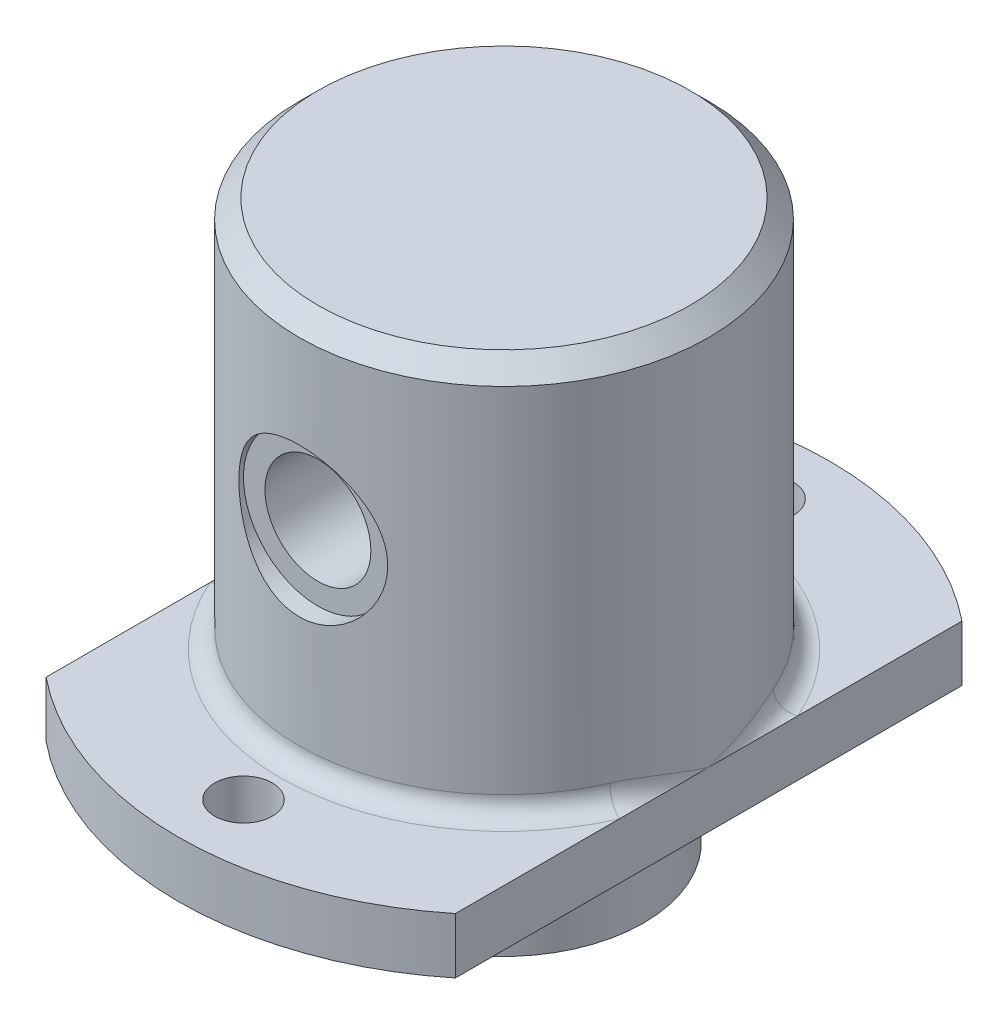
ISO-10303-21;
HEADER;
FILE_DESCRIPTION(('STEP AP214'),'2;1');
FILE_NAME('part.step','',(''),(''),'','','');
FILE_SCHEMA(('AUTOMOTIVE_DESIGN { 1 0 10303 214 1 1 1 1 }'));
ENDSEC;
DATA;
#1=APPLICATION_CONTEXT('core data for automotive mechanical design processes');
#2=APPLICATION_PROTOCOL_DEFINITION('international standard','automotive_design',2000,#1);
#3=PRODUCT_CONTEXT('',#1,'mechanical');
#4=PRODUCT('Part','Part','',(#3));
#5=PRODUCT_RELATED_PRODUCT_CATEGORY('part','',(#4));
#6=PRODUCT_DEFINITION_FORMATION('','',#4);
#7=PRODUCT_DEFINITION_CONTEXT('part definition',#1,'design');
#8=PRODUCT_DEFINITION('design','',#6,#7);
#9=PRODUCT_DEFINITION_SHAPE('','',#8);
#10=(LENGTH_UNIT() NAMED_UNIT(*) SI_UNIT(.MILLI.,.METRE.));
#11=(NAMED_UNIT(*) PLANE_ANGLE_UNIT() SI_UNIT($,.RADIAN.));
#12=(NAMED_UNIT(*) SI_UNIT($,.STERADIAN.) SOLID_ANGLE_UNIT());
#13=UNCERTAINTY_MEASURE_WITH_UNIT(LENGTH_MEASURE(1.E-05),#10,'distance_accuracy_value','');
#14=(GEOMETRIC_REPRESENTATION_CONTEXT(3) GLOBAL_UNCERTAINTY_ASSIGNED_CONTEXT((#13)) GLOBAL_UNIT_ASSIGNED_CONTEXT((#10,
#11,#12)) REPRESENTATION_CONTEXT('',''));
#15=CARTESIAN_POINT('',(0.,0.,0.));
#16=DIRECTION('',(0.,0.,1.));
#17=DIRECTION('',(1.,0.,0.));
#18=AXIS2_PLACEMENT_3D('',#15,#16,#17);
#19=CARTESIAN_POINT('',(-11.,9.,0.));
#20=DIRECTION('',(0.,1.,0.));
#21=DIRECTION('',(0.,0.,1.));
#22=AXIS2_PLACEMENT_3D('',#19,#20,#21);
#23=PLANE('',#22);
#24=CARTESIAN_POINT('',(0.,9.,14.));
#25=DIRECTION('',(0.,1.,0.));
#26=DIRECTION('',(0.,0.,1.));
#27=AXIS2_PLACEMENT_3D('',#24,#25,#26);
#28=CIRCLE('',#27,1.55);
#29=CARTESIAN_POINT('',(0.,9.,15.55));
#30=VERTEX_POINT('',#29);
#31=EDGE_CURVE('E217',#30,#30,#28,.T.);
#32=ORIENTED_EDGE('',*,*,#31,.F.);
#33=EDGE_LOOP('',(#32));
#34=FACE_BOUND('',#33,.T.);
#35=DIRECTION('',(0.,0.,-1.));
#36=VECTOR('',#35,1.);
#37=CARTESIAN_POINT('',(11.,9.,0.));
#38=LINE('',#37,#36);
#39=CARTESIAN_POINT('',(11.,9.,13.6106575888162));
#40=VERTEX_POINT('',#39);
#41=CARTESIAN_POINT('',(11.,9.,4.79583152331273));
#42=VERTEX_POINT('',#41);
#43=EDGE_CURVE('E246',#40,#42,#38,.T.);
#44=ORIENTED_EDGE('',*,*,#43,.T.);
#45=CARTESIAN_POINT('',(0.,9.,0.));
#46=DIRECTION('',(0.,1.,0.));
#47=DIRECTION('',(0.,0.,1.));
#48=AXIS2_PLACEMENT_3D('',#45,#46,#47);
#49=CIRCLE('',#48,12.);
#50=CARTESIAN_POINT('',(-11.,9.,4.79583152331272));
#51=VERTEX_POINT('',#50);
#52=EDGE_CURVE('E129',#42,#51,#49,.F.);
#53=ORIENTED_EDGE('',*,*,#52,.T.);
#54=DIRECTION('',(0.,0.,-1.));
#55=VECTOR('',#54,1.);
#56=CARTESIAN_POINT('',(-11.,9.,0.));
#57=LINE('',#56,#55);
#58=CARTESIAN_POINT('',(-11.,9.,13.6106575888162));
#59=VERTEX_POINT('',#58);
#60=EDGE_CURVE('E114',#59,#51,#57,.T.);
#61=ORIENTED_EDGE('',*,*,#60,.F.);
#62=CARTESIAN_POINT('',(0.,9.,0.));
#63=DIRECTION('',(0.,1.,0.));
#64=DIRECTION('',(0.,0.,1.));
#65=AXIS2_PLACEMENT_3D('',#62,#63,#64);
#66=CIRCLE('',#65,17.5);
#67=EDGE_CURVE('E127',#59,#40,#66,.T.);
#68=ORIENTED_EDGE('',*,*,#67,.T.);
#69=EDGE_LOOP('',(#44,#53,#61,#68));
#70=FACE_BOUND('',#69,.T.);
#71=ADVANCED_FACE('F38',(#34,#70),#23,.T.);
#72=CARTESIAN_POINT('',(0.,9.,-14.));
#73=DIRECTION('',(0.,1.,0.));
#74=DIRECTION('',(0.,0.,1.));
#75=AXIS2_PLACEMENT_3D('',#72,#73,#74);
#76=CIRCLE('',#75,1.55);
#77=CARTESIAN_POINT('',(0.,9.,-12.45));
#78=VERTEX_POINT('',#77);
#79=EDGE_CURVE('E226',#78,#78,#76,.T.);
#80=ORIENTED_EDGE('',*,*,#79,.F.);
#81=EDGE_LOOP('',(#80));
#82=FACE_BOUND('',#81,.T.);
#83=CARTESIAN_POINT('',(-11.,9.,-4.79583152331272));
#84=VERTEX_POINT('',#83);
#85=CARTESIAN_POINT('',(-11.,9.,-13.6106575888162));
#86=VERTEX_POINT('',#85);
#87=EDGE_CURVE('E61',#84,#86,#57,.T.);
#88=ORIENTED_EDGE('',*,*,#87,.F.);
#89=CARTESIAN_POINT('',(0.,9.,0.));
#90=DIRECTION('',(0.,1.,0.));
#91=DIRECTION('',(0.,0.,1.));
#92=AXIS2_PLACEMENT_3D('',#89,#90,#91);
#93=CIRCLE('',#92,12.);
#94=CARTESIAN_POINT('',(11.,9.,-4.79583152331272));
#95=VERTEX_POINT('',#94);
#96=EDGE_CURVE('E56',#84,#95,#93,.F.);
#97=ORIENTED_EDGE('',*,*,#96,.T.);
#98=CARTESIAN_POINT('',(11.,9.,-13.6106575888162));
#99=VERTEX_POINT('',#98);
#100=EDGE_CURVE('E240',#95,#99,#38,.T.);
#101=ORIENTED_EDGE('',*,*,#100,.T.);
#102=EDGE_CURVE('E137',#99,#86,#66,.T.);
#103=ORIENTED_EDGE('',*,*,#102,.T.);
#104=EDGE_LOOP('',(#88,#97,#101,#103));
#105=FACE_BOUND('',#104,.T.);
#106=ADVANCED_FACE('F356',(#82,#105),#23,.T.);
#107=CARTESIAN_POINT('',(0.,0.,0.));
#108=DIRECTION('',(0.,1.,0.));
#109=DIRECTION('',(0.,0.,1.));
#110=AXIS2_PLACEMENT_3D('',#107,#108,#109);
#111=CYLINDRICAL_SURFACE('',#110,17.5);
#112=DIRECTION('',(0.,1.,0.));
#113=VECTOR('',#112,1.);
#114=CARTESIAN_POINT('',(-11.,-0.999999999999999,-13.6106575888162));
#115=LINE('',#114,#113);
#116=CARTESIAN_POINT('',(-11.,6.,-13.6106575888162));
#117=VERTEX_POINT('',#116);
#118=EDGE_CURVE('E122',#117,#86,#115,.T.);
#119=ORIENTED_EDGE('',*,*,#118,.T.);
#120=ORIENTED_EDGE('',*,*,#102,.F.);
#121=DIRECTION('',(0.,1.,0.));
#122=VECTOR('',#121,1.);
#123=CARTESIAN_POINT('',(11.,-0.999999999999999,-13.6106575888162));
#124=LINE('',#123,#122);
#125=CARTESIAN_POINT('',(11.,6.,-13.6106575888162));
#126=VERTEX_POINT('',#125);
#127=EDGE_CURVE('E250',#126,#99,#124,.T.);
#128=ORIENTED_EDGE('',*,*,#127,.F.);
#129=CARTESIAN_POINT('',(0.,6.,0.));
#130=DIRECTION('',(0.,1.,0.));
#131=DIRECTION('',(0.,0.,1.));
#132=AXIS2_PLACEMENT_3D('',#129,#130,#131);
#133=CIRCLE('',#132,17.5);
#134=EDGE_CURVE('E138',#126,#117,#133,.T.);
#135=ORIENTED_EDGE('',*,*,#134,.T.);
#136=EDGE_LOOP('',(#119,#120,#128,#135));
#137=FACE_BOUND('',#136,.T.);
#138=ADVANCED_FACE('F361',(#137),#111,.T.);
#139=DIRECTION('',(0.,1.,0.));
#140=VECTOR('',#139,1.);
#141=CARTESIAN_POINT('',(-11.,-0.999999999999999,13.6106575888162));
#142=LINE('',#141,#140);
#143=CARTESIAN_POINT('',(-11.,6.,13.6106575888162));
#144=VERTEX_POINT('',#143);
#145=EDGE_CURVE('E111',#144,#59,#142,.T.);
#146=ORIENTED_EDGE('',*,*,#145,.F.);
#147=CARTESIAN_POINT('',(11.,6.,13.6106575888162));
#148=VERTEX_POINT('',#147);
#149=EDGE_CURVE('E142',#144,#148,#133,.T.);
#150=ORIENTED_EDGE('',*,*,#149,.T.);
#151=DIRECTION('',(0.,1.,0.));
#152=VECTOR('',#151,1.);
#153=CARTESIAN_POINT('',(11.,-0.999999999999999,13.6106575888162));
#154=LINE('',#153,#152);
#155=EDGE_CURVE('E136',#148,#40,#154,.T.);
#156=ORIENTED_EDGE('',*,*,#155,.T.);
#157=ORIENTED_EDGE('',*,*,#67,.F.);
#158=EDGE_LOOP('',(#146,#150,#156,#157));
#159=FACE_BOUND('',#158,.T.);
#160=ADVANCED_FACE('F134',(#159),#111,.T.);
#161=CARTESIAN_POINT('',(-17.5,6.,0.));
#162=DIRECTION('',(0.,-1.,0.));
#163=DIRECTION('',(0.,0.,-1.));
#164=AXIS2_PLACEMENT_3D('',#161,#162,#163);
#165=PLANE('',#164);
#166=CARTESIAN_POINT('',(0.,6.,-14.));
#167=DIRECTION('',(0.,-1.,0.));
#168=DIRECTION('',(0.,0.,-1.));
#169=AXIS2_PLACEMENT_3D('',#166,#167,#168);
#170=CIRCLE('',#169,1.55);
#171=CARTESIAN_POINT('',(0.,6.,-15.55));
#172=VERTEX_POINT('',#171);
#173=EDGE_CURVE('E43',#172,#172,#170,.T.);
#174=ORIENTED_EDGE('',*,*,#173,.F.);
#175=EDGE_LOOP('',(#174));
#176=FACE_BOUND('',#175,.T.);
#177=CARTESIAN_POINT('',(0.,6.,14.));
#178=DIRECTION('',(0.,-1.,0.));
#179=DIRECTION('',(0.,0.,-1.));
#180=AXIS2_PLACEMENT_3D('',#177,#178,#179);
#181=CIRCLE('',#180,1.55);
#182=CARTESIAN_POINT('',(0.,6.,12.45));
#183=VERTEX_POINT('',#182);
#184=EDGE_CURVE('E214',#183,#183,#181,.T.);
#185=ORIENTED_EDGE('',*,*,#184,.F.);
#186=EDGE_LOOP('',(#185));
#187=FACE_BOUND('',#186,.T.);
#188=ORIENTED_EDGE('',*,*,#149,.F.);
#189=DIRECTION('',(0.,0.,1.));
#190=VECTOR('',#189,1.);
#191=CARTESIAN_POINT('',(-11.,6.,0.));
#192=LINE('',#191,#190);
#193=EDGE_CURVE('E117',#117,#144,#192,.T.);
#194=ORIENTED_EDGE('',*,*,#193,.F.);
#195=ORIENTED_EDGE('',*,*,#134,.F.);
#196=DIRECTION('',(0.,0.,1.));
#197=VECTOR('',#196,1.);
#198=CARTESIAN_POINT('',(11.,6.,0.));
#199=LINE('',#198,#197);
#200=EDGE_CURVE('E244',#126,#148,#199,.T.);
#201=ORIENTED_EDGE('',*,*,#200,.T.);
#202=EDGE_LOOP('',(#188,#194,#195,#201));
#203=FACE_BOUND('',#202,.T.);
#204=CARTESIAN_POINT('',(0.,6.,0.));
#205=DIRECTION('',(0.,-1.,0.));
#206=DIRECTION('',(0.,0.,-1.));
#207=AXIS2_PLACEMENT_3D('',#204,#205,#206);
#208=CIRCLE('',#207,7.5);
#209=CARTESIAN_POINT('',(0.,6.,-7.5));
#210=VERTEX_POINT('',#209);
#211=EDGE_CURVE('E237',#210,#210,#208,.T.);
#212=ORIENTED_EDGE('',*,*,#211,.F.);
#213=EDGE_LOOP('',(#212));
#214=FACE_BOUND('',#213,.T.);
#215=ADVANCED_FACE('F263',(#176,#187,#203,#214),#165,.T.);
#216=CARTESIAN_POINT('',(0.,30.,0.));
#217=DIRECTION('',(0.,1.,0.));
#218=DIRECTION('',(0.,0.,1.));
#219=AXIS2_PLACEMENT_3D('',#216,#217,#218);
#220=PLANE('',#219);
#221=CARTESIAN_POINT('',(0.,30.,0.));
#222=DIRECTION('',(0.,1.,0.));
#223=DIRECTION('',(0.,0.,1.));
#224=AXIS2_PLACEMENT_3D('',#221,#222,#223);
#225=CIRCLE('',#224,10.);
#226=CARTESIAN_POINT('',(0.,30.,10.));
#227=VERTEX_POINT('',#226);
#228=EDGE_CURVE('E48',#227,#227,#225,.T.);
#229=ORIENTED_EDGE('',*,*,#228,.T.);
#230=EDGE_LOOP('',(#229));
#231=FACE_BOUND('',#230,.T.);
#232=ADVANCED_FACE('F408',(#231),#220,.T.);
#233=CARTESIAN_POINT('',(0.,0.,0.));
#234=DIRECTION('',(0.,1.,0.));
#235=DIRECTION('',(0.,0.,1.));
#236=AXIS2_PLACEMENT_3D('',#233,#234,#235);
#237=CYLINDRICAL_SURFACE('',#236,11.);
#238=CARTESIAN_POINT('',(0.,29.,0.));
#239=DIRECTION('',(0.,1.,0.));
#240=DIRECTION('',(0.,0.,1.));
#241=AXIS2_PLACEMENT_3D('',#238,#239,#240);
#242=CIRCLE('',#241,11.);
#243=CARTESIAN_POINT('',(0.,29.,11.));
#244=VERTEX_POINT('',#243);
#245=EDGE_CURVE('E12',#244,#244,#242,.F.);
#246=ORIENTED_EDGE('',*,*,#245,.T.);
#247=EDGE_LOOP('',(#246));
#248=FACE_BOUND('',#247,.T.);
#249=CARTESIAN_POINT('',(0.,16.,11.));
#250=CARTESIAN_POINT('',(0.108518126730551,15.9999997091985,11.0000002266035));
#251=CARTESIAN_POINT('',(0.217031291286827,16.0044197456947,10.9983905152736));
#252=CARTESIAN_POINT('',(0.433282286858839,16.0220557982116,10.9919958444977));
#253=CARTESIAN_POINT('',(0.541019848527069,16.0352747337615,10.9872098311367));
#254=CARTESIAN_POINT('',(0.754845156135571,16.070377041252,10.974591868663));
#255=CARTESIAN_POINT('',(0.860933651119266,16.0922563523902,10.9667613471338));
#256=CARTESIAN_POINT('',(1.07077170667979,16.1444637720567,10.948268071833));
#257=CARTESIAN_POINT('',(1.17452034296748,16.1747951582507,10.9376042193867));
#258=CARTESIAN_POINT('',(1.48070658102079,16.2779413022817,10.9018115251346));
#259=CARTESIAN_POINT('',(1.6787218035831,16.363014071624,10.87284149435));
#260=CARTESIAN_POINT('',(2.0575471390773,16.5630694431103,10.8075711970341));
#261=CARTESIAN_POINT('',(2.2383529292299,16.6780595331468,10.7712690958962));
#262=CARTESIAN_POINT('',(2.58506410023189,16.9395658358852,10.6934621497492));
#263=CARTESIAN_POINT('',(2.75018962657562,17.0870755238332,10.6518162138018));
#264=CARTESIAN_POINT('',(3.05397061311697,17.4073160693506,10.5687333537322));
#265=CARTESIAN_POINT('',(3.1926186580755,17.5800539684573,10.5272964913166));
#266=CARTESIAN_POINT('',(3.44434007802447,17.9533099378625,10.4477077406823));
#267=CARTESIAN_POINT('',(3.55633540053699,18.1545945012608,10.4097238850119));
#268=CARTESIAN_POINT('',(3.74453898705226,18.5747429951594,10.3435224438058));
#269=CARTESIAN_POINT('',(3.8207605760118,18.7936003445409,10.3153012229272));
#270=CARTESIAN_POINT('',(3.93221347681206,19.2337173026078,10.2733217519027));
#271=CARTESIAN_POINT('',(3.96892832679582,19.4545498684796,10.2590420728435));
#272=CARTESIAN_POINT('',(4.00496437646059,19.8996675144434,10.2450315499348));
#273=CARTESIAN_POINT('',(4.00429985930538,20.1239512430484,10.2452951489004));
#274=CARTESIAN_POINT('',(3.9667353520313,20.556304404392,10.2598897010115));
#275=CARTESIAN_POINT('',(3.93185708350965,20.7645808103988,10.2734357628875));
#276=CARTESIAN_POINT('',(3.8301848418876,21.1720929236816,10.3117702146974));
#277=CARTESIAN_POINT('',(3.76338635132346,21.3713273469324,10.3365601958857));
#278=CARTESIAN_POINT('',(3.59860097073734,21.7593527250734,10.3950857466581));
#279=CARTESIAN_POINT('',(3.50006900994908,21.9478878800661,10.4289757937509));
#280=CARTESIAN_POINT('',(3.27499293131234,22.3063495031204,10.5018277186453));
#281=CARTESIAN_POINT('',(3.14843956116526,22.4762697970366,10.5407912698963));
#282=CARTESIAN_POINT('',(2.8615335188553,22.8039194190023,10.6223913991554));
#283=CARTESIAN_POINT('',(2.6995556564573,22.960209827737,10.6651048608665));
#284=CARTESIAN_POINT('',(2.35118575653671,23.243822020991,10.7472749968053));
#285=CARTESIAN_POINT('',(2.16479040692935,23.371139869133,10.7867312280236));
#286=CARTESIAN_POINT('',(1.76938296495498,23.5946543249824,10.8586443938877));
#287=CARTESIAN_POINT('',(1.56009488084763,23.6903984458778,10.8909975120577));
#288=CARTESIAN_POINT('',(1.12691583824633,23.8448502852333,10.9442944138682));
#289=CARTESIAN_POINT('',(0.903031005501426,23.9035734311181,10.9652429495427));
#290=CARTESIAN_POINT('',(0.459144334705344,23.9796120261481,10.9925485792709));
#291=CARTESIAN_POINT('',(0.239516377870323,23.9988669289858,10.9995884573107));
#292=CARTESIAN_POINT('',(-0.199918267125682,24.0010350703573,11.000375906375));
#293=CARTESIAN_POINT('',(-0.419724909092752,23.9839558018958,10.9941262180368));
#294=CARTESIAN_POINT('',(-0.845072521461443,23.915433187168,10.9694878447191));
#295=CARTESIAN_POINT('',(-1.05084266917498,23.8652375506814,10.9515401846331));
#296=CARTESIAN_POINT('',(-1.45091434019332,23.7335262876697,10.9057517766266));
#297=CARTESIAN_POINT('',(-1.64521436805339,23.6520065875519,10.8779097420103));
#298=CARTESIAN_POINT('',(-2.02306155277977,23.4574088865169,10.8141114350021));
#299=CARTESIAN_POINT('',(-2.20614086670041,23.3434933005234,10.7779454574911));
#300=CARTESIAN_POINT('',(-2.55118135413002,23.0882938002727,10.7015304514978));
#301=CARTESIAN_POINT('',(-2.71313504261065,22.9470002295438,10.6612799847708));
#302=CARTESIAN_POINT('',(-3.02054310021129,22.6319844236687,10.5784236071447));
#303=CARTESIAN_POINT('',(-3.16461797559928,22.4569148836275,10.5358088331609));
#304=CARTESIAN_POINT('',(-3.42158820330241,22.0842180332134,10.4551865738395));
#305=CARTESIAN_POINT('',(-3.53448160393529,21.8865893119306,10.4171793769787));
#306=CARTESIAN_POINT('',(-3.72578370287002,21.4732541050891,10.3503083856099));
#307=CARTESIAN_POINT('',(-3.80411923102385,21.2575104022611,10.3214640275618));
#308=CARTESIAN_POINT('',(-3.92287909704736,20.8145651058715,10.2769217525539));
#309=CARTESIAN_POINT('',(-3.96332500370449,20.5873701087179,10.2612163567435));
#310=CARTESIAN_POINT('',(-4.00329400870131,20.1428173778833,10.245684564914));
#311=CARTESIAN_POINT('',(-4.00515133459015,19.9256992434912,10.2449524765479));
#312=CARTESIAN_POINT('',(-3.97380469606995,19.4944208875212,10.2571513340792));
#313=CARTESIAN_POINT('',(-3.94060366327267,19.2802604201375,10.2700811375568));
#314=CARTESIAN_POINT('',(-3.84185635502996,18.866810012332,10.3074143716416));
#315=CARTESIAN_POINT('',(-3.77720646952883,18.6672748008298,10.3314989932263));
#316=CARTESIAN_POINT('',(-3.61816905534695,18.2817547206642,10.3882601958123));
#317=CARTESIAN_POINT('',(-3.52377423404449,18.0957731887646,10.4209388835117));
#318=CARTESIAN_POINT('',(-3.30242059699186,17.7325159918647,10.4932450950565));
#319=CARTESIAN_POINT('',(-3.17406750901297,17.5561430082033,10.5331386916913));
#320=CARTESIAN_POINT('',(-2.89069247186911,17.2267038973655,10.6144069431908));
#321=CARTESIAN_POINT('',(-2.73566230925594,17.0736449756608,10.6557820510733));
#322=CARTESIAN_POINT('',(-2.39397199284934,16.7873845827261,10.7378363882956));
#323=CARTESIAN_POINT('',(-2.20612371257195,16.6555460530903,10.7783791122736));
#324=CARTESIAN_POINT('',(-1.90891818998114,16.4830096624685,10.8335715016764));
#325=CARTESIAN_POINT('',(-1.80721425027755,16.4296775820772,10.8510404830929));
#326=CARTESIAN_POINT('',(-1.5993005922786,16.3318380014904,10.8836243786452));
#327=CARTESIAN_POINT('',(-1.49309284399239,16.2873266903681,10.8987403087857));
#328=CARTESIAN_POINT('',(-1.27489280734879,16.2067915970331,10.9264345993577));
#329=CARTESIAN_POINT('',(-1.16282946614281,16.1709422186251,10.9389601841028));
#330=CARTESIAN_POINT('',(-0.935724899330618,16.1092087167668,10.9607217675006));
#331=CARTESIAN_POINT('',(-0.820684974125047,16.0833203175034,10.9699591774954));
#332=CARTESIAN_POINT('',(-0.588557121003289,16.0417805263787,10.9848588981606));
#333=CARTESIAN_POINT('',(-0.471469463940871,16.0261277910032,10.9905216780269));
#334=CARTESIAN_POINT('',(-0.236252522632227,16.0052380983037,10.9980919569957));
#335=CARTESIAN_POINT('',(-0.11812332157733,16.0000003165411,10.9999997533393));
#336=CARTESIAN_POINT('',(0.,16.,11.));
#337=B_SPLINE_CURVE_WITH_KNOTS('',3,(#249,#250,#251,#252,#253,#254,#255,#256,#257,#258,#259,
#260,#261,#262,#263,#264,#265,#266,#267,#268,#269,#270,#271,#272,#273,#274,#275,#276,#277,#278,
#279,#280,#281,#282,#283,#284,#285,#286,#287,#288,#289,#290,#291,#292,#293,#294,#295,#296,#297,
#298,#299,#300,#301,#302,#303,#304,#305,#306,#307,#308,#309,#310,#311,#312,#313,#314,#315,#316,
#317,#318,#319,#320,#321,#322,#323,#324,#325,#326,#327,#328,#329,#330,#331,#332,#333,#334,#335,
#336),.UNSPECIFIED.,.T.,.F.,(4,2,2,2,2,2,2,2,2,2,2,2,2,2,2,2,2,2,2,2,2,2,2,2,2,2,2,2,2,2,2,2,2,
2,2,2,2,2,2,2,2,2,2,4),(0.,0.325443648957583,0.650995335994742,0.97639455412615,
1.30192013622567,1.95105392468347,2.60035033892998,3.27323297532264,3.946303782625,
4.64318153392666,5.33979950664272,6.00923247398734,6.67840964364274,7.31028887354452,
7.94225755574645,8.58571857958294,9.22939238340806,9.913550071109,10.5978006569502,
11.2914695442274,11.9848491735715,12.6432497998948,13.3015146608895,13.9362952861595,
14.57115849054,15.2242188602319,15.8775099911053,16.5663909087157,17.2553149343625,
17.9456907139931,18.6356732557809,19.2837885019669,19.9318495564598,20.562434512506,
21.1931741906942,21.8555070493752,22.5180441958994,23.213470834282,23.561586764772,
23.9095519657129,24.2640282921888,24.6183522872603,24.9726297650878,25.3268791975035),.UNSPECIFIED.);
#338=CARTESIAN_POINT('',(0.,16.,11.));
#339=VERTEX_POINT('',#338);
#340=EDGE_CURVE('E140',#339,#339,#337,.T.);
#341=ORIENTED_EDGE('',*,*,#340,.F.);
#342=EDGE_LOOP('',(#341));
#343=FACE_BOUND('',#342,.T.);
#344=CARTESIAN_POINT('',(-9.64754835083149,9.87976879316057,-5.28439313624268));
#345=CARTESIAN_POINT('',(-9.71352605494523,9.35071472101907,-5.16393974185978));
#346=CARTESIAN_POINT('',(-10.1526536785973,9.06506252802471,-5.31992064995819));
#347=CARTESIAN_POINT('',(-10.5917813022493,8.77941033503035,-5.4759015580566));
#348=CARTESIAN_POINT('',(-11.,9.,-5.76479251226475));
#349=CARTESIAN_POINT('',(-9.66931449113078,9.89258981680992,-5.24465741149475));
#350=CARTESIAN_POINT('',(-9.72944401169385,9.36796938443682,-5.13371022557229));
#351=CARTESIAN_POINT('',(-10.1589289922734,9.07991418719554,-5.2874934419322));
#352=CARTESIAN_POINT('',(-10.5883727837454,8.79177092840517,-5.44147399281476));
#353=CARTESIAN_POINT('',(-11.,9.,-5.72144444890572));
#354=CARTESIAN_POINT('',(-9.69097158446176,9.90412610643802,-5.20453393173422));
#355=CARTESIAN_POINT('',(-9.74586995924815,9.38431675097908,-5.10223425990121));
#356=CARTESIAN_POINT('',(-10.1659302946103,9.09421862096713,-5.25396064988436));
#357=CARTESIAN_POINT('',(-10.5859471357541,8.80404331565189,-5.4058817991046));
#358=CARTESIAN_POINT('',(-11.,9.,-5.67767338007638));
#359=CARTESIAN_POINT('',(-9.73397732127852,9.92488501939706,-5.12364887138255));
#360=CARTESIAN_POINT('',(-9.7793629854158,9.41511154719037,-5.03734253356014));
#361=CARTESIAN_POINT('',(-10.1810920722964,9.12166088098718,-5.18504422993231));
#362=CARTESIAN_POINT('',(-10.5827796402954,8.82813352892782,-5.33293756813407));
#363=CARTESIAN_POINT('',(-11.,9.,-5.58943513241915));
#364=CARTESIAN_POINT('',(-9.75532611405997,9.93410880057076,-5.08288762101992));
#365=CARTESIAN_POINT('',(-9.79643120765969,9.42957514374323,-5.00392879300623));
#366=CARTESIAN_POINT('',(-10.1892519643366,9.13479928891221,-5.14966153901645));
#367=CARTESIAN_POINT('',(-10.5820270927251,8.83995773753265,-5.29558524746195));
#368=CARTESIAN_POINT('',(-11.,9.,-5.54496831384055));
#369=CARTESIAN_POINT('',(-9.81870336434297,9.95867158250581,-4.95999418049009));
#370=CARTESIAN_POINT('',(-9.84799678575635,9.47003508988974,-4.90171444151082));
#371=CARTESIAN_POINT('',(-10.2149992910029,9.17231739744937,-5.04140537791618));
#372=CARTESIAN_POINT('',(-10.5818231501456,8.8743378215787,-5.18184919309));
#373=CARTESIAN_POINT('',(-11.,9.,-5.41090274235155));
#374=CARTESIAN_POINT('',(-9.86017030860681,9.97096236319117,-4.87705610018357));
#375=CARTESIAN_POINT('',(-9.88322341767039,9.49347629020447,-4.83024443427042));
#376=CARTESIAN_POINT('',(-10.2338880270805,9.19487350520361,-4.9662612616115));
#377=CARTESIAN_POINT('',(-10.5843685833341,8.89608270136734,-5.10299769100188));
#378=CARTESIAN_POINT('',(-11.,9.,-5.32042483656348));
#379=CARTESIAN_POINT('',(-9.94084427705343,9.98885508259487,-4.71042646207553));
#380=CARTESIAN_POINT('',(-9.95351500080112,9.53357341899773,-4.68346515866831));
#381=CARTESIAN_POINT('',(-10.2733921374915,9.2350396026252,-4.81241652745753));
#382=CARTESIAN_POINT('',(-10.5930879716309,8.93632231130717,-4.94207118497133));
#383=CARTESIAN_POINT('',(-11.,9.,-5.13864704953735));
#384=CARTESIAN_POINT('',(-9.9800677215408,9.99451385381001,-4.62674759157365));
#385=CARTESIAN_POINT('',(-9.98860863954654,9.55036355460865,-4.60816952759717));
#386=CARTESIAN_POINT('',(-10.2939911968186,9.25269061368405,-4.73375221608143));
#387=CARTESIAN_POINT('',(-10.5992012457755,8.95488905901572,-4.85999377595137));
#388=CARTESIAN_POINT('',(-11.,9.,-5.04736100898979));
#389=CARTESIAN_POINT('',(-10.0564734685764,10.000441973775,-4.45824096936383));
#390=CARTESIAN_POINT('',(-10.0581588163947,9.57827253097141,-4.45426755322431));
#391=CARTESIAN_POINT('',(-10.3360805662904,9.28368752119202,-4.573295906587));
#392=CARTESIAN_POINT('',(-10.6138302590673,8.98897735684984,-4.69297897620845));
#393=CARTESIAN_POINT('',(-11.,9.,-4.86353560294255));
#394=CARTESIAN_POINT('',(-10.0936540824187,10.0007069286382,-4.37341233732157));
#395=CARTESIAN_POINT('',(-10.0926497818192,9.58944482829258,-4.37561958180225));
#396=CARTESIAN_POINT('',(-10.3575715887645,9.29702989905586,-4.49150141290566));
#397=CARTESIAN_POINT('',(-10.6223346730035,9.00453578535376,-4.60799104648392));
#398=CARTESIAN_POINT('',(-11.,9.,-4.77099527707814));
#399=CARTESIAN_POINT('',(-10.2038133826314,9.99463444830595,-4.11318123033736));
#400=CARTESIAN_POINT('',(-10.19568333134,9.61590317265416,-4.1327218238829));
#401=CARTESIAN_POINT('',(-10.4234062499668,9.33181614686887,-4.23829054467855));
#402=CARTESIAN_POINT('',(-10.6504716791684,9.04737220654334,-4.34639349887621));
#403=CARTESIAN_POINT('',(-11.,9.,-4.48710679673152));
#404=CARTESIAN_POINT('',(-10.2732818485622,9.98105438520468,-3.93642054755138));
#405=CARTESIAN_POINT('',(-10.2628837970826,9.62361481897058,-3.96331973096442));
#406=CARTESIAN_POINT('',(-10.4679951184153,9.3470064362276,-4.06315673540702));
#407=CARTESIAN_POINT('',(-10.6725936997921,9.07028649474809,-4.16512533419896));
#408=CARTESIAN_POINT('',(-11.,9.,-4.2942769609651));
#409=CARTESIAN_POINT('',(-10.4026014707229,9.94024976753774,-3.58074973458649));
#410=CARTESIAN_POINT('',(-10.3894815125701,9.6233459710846,-3.61851627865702));
#411=CARTESIAN_POINT('',(-10.5541542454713,9.36448775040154,-3.70708136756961));
#412=CARTESIAN_POINT('',(-10.7183128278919,9.10553265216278,-3.7977588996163));
#413=CARTESIAN_POINT('',(-11.,9.,-3.90627243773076));
#414=CARTESIAN_POINT('',(-10.4624467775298,9.91301695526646,-3.40183836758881));
#415=CARTESIAN_POINT('',(-10.4491233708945,9.61554079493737,-3.44275375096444));
#416=CARTESIAN_POINT('',(-10.5957226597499,9.3667709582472,-3.52613635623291));
#417=CARTESIAN_POINT('',(-10.7419502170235,9.11802676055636,-3.61125834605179));
#418=CARTESIAN_POINT('',(-11.,9.,-3.71109640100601));
#419=CARTESIAN_POINT('',(-10.5728751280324,9.84823519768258,-3.04139326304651));
#420=CARTESIAN_POINT('',(-10.5599317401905,9.58808739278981,-3.08620675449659));
#421=CARTESIAN_POINT('',(-10.6742501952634,9.36131929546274,-3.15923984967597));
#422=CARTESIAN_POINT('',(-10.788194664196,9.13457732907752,-3.23401771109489));
#423=CARTESIAN_POINT('',(-11.,9.,-3.31788355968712));
#424=CARTESIAN_POINT('',(-10.6233923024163,9.81061724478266,-2.85984996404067));
#425=CARTESIAN_POINT('',(-10.6112414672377,9.56844135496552,-2.90504870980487));
#426=CARTESIAN_POINT('',(-10.7111759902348,9.35351607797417,-2.97326264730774));
#427=CARTESIAN_POINT('',(-10.8108547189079,9.13867455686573,-3.04287947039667));
#428=CARTESIAN_POINT('',(-11.,9.,-3.11983632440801));
#429=CARTESIAN_POINT('',(-10.7147744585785,9.72779613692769,-2.49576758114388));
#430=CARTESIAN_POINT('',(-10.7044304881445,9.5202774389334,-2.54017007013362));
#431=CARTESIAN_POINT('',(-10.7790157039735,9.33016431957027,-2.59872484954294));
#432=CARTESIAN_POINT('',(-10.8533508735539,9.14014153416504,-2.65866938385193));
#433=CARTESIAN_POINT('',(-11.,9.,-2.72265554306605));
#434=CARTESIAN_POINT('',(-10.755636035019,9.68259031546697,-2.31322816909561));
#435=CARTESIAN_POINT('',(-10.746461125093,9.49177834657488,-2.35613556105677));
#436=CARTESIAN_POINT('',(-10.8099275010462,9.31461305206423,-2.41016336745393));
#437=CARTESIAN_POINT('',(-10.8732455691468,9.13756009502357,-2.46526159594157));
#438=CARTESIAN_POINT('',(-11.,9.,-2.52352163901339));
#439=CARTESIAN_POINT('',(-10.8609980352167,9.5426594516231,-1.77950613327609));
#440=CARTESIAN_POINT('',(-10.8547285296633,9.3994563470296,-1.81805823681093));
#441=CARTESIAN_POINT('',(-10.8904044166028,9.26088033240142,-1.85733680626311));
#442=CARTESIAN_POINT('',(-10.9254921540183,9.12267168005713,-1.90055735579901));
#443=CARTESIAN_POINT('',(-11.,9.,-1.94127941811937));
#444=CARTESIAN_POINT('',(-10.9127498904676,9.44058091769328,-1.42738475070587));
#445=CARTESIAN_POINT('',(-10.9088854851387,9.32667461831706,-1.45885006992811));
#446=CARTESIAN_POINT('',(-10.9310327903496,9.215031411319,-1.4907275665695));
#447=CARTESIAN_POINT('',(-10.9530326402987,9.1036350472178,-1.52453850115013));
#448=CARTESIAN_POINT('',(-11.,9.,-1.55714700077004));
#449=CARTESIAN_POINT('',(-10.9818826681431,9.22768007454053,-0.723211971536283));
#450=CARTESIAN_POINT('',(-10.9809495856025,9.17093788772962,-0.740548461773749));
#451=CARTESIAN_POINT('',(-10.9855381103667,9.11379758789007,-0.756072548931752));
#452=CARTESIAN_POINT('',(-10.9899917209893,9.05693467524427,-0.773468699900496));
#453=CARTESIAN_POINT('',(-11.,9.,-0.788958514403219));
#454=CARTESIAN_POINT('',(-10.9993661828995,9.11688490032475,-0.371163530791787));
#455=CARTESIAN_POINT('',(-10.9993357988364,9.0876668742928,-0.379615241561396));
#456=CARTESIAN_POINT('',(-10.9994949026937,9.05844169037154,-0.388034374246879));
#457=CARTESIAN_POINT('',(-10.999652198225,9.02922149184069,-0.396487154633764));
#458=CARTESIAN_POINT('',(-11.,9.,-0.404905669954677));
#459=CARTESIAN_POINT('',(-10.9999943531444,9.00405093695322,-0.0128634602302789));
#460=CARTESIAN_POINT('',(-10.999994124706,9.0030382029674,-0.0131558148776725));
#461=CARTESIAN_POINT('',(-10.9999955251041,9.00202546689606,-0.0134481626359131));
#462=CARTESIAN_POINT('',(-10.999996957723,9.00101273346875,-0.0137405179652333));
#463=CARTESIAN_POINT('',(-11.,9.,-0.0140328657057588));
#464=CARTESIAN_POINT('',(-10.9999999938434,9.00202545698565,-0.00643169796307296));
#465=CARTESIAN_POINT('',(-11.0000000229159,9.0015190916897,-0.00657787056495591));
#466=CARTESIAN_POINT('',(-11.0000000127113,9.00101272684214,-0.00672404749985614));
#467=CARTESIAN_POINT('',(-11.0000000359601,9.0005063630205,-0.00687022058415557));
#468=CARTESIAN_POINT('',(-11.,9.,-0.00701639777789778));
#469=CARTESIAN_POINT('',(-11.,9.,0.));
#470=CARTESIAN_POINT('',(-11.,9.,0.));
#471=CARTESIAN_POINT('',(-11.,9.,0.));
#472=CARTESIAN_POINT('',(-11.,9.,0.));
#473=CARTESIAN_POINT('',(-11.,9.,0.));
#474=(BOUNDED_SURFACE() B_SPLINE_SURFACE(3,2,((#344,#345,#346,#347,#348),(#349,#350,#351,#352,
#353),(#354,#355,#356,#357,#358),(#359,#360,#361,#362,#363),(#364,#365,#366,#367,#368),(#369,
#370,#371,#372,#373),(#374,#375,#376,#377,#378),(#379,#380,#381,#382,#383),(#384,#385,#386,#387,
#388),(#389,#390,#391,#392,#393),(#394,#395,#396,#397,#398),(#399,#400,#401,#402,#403),(#404,
#405,#406,#407,#408),(#409,#410,#411,#412,#413),(#414,#415,#416,#417,#418),(#419,#420,#421,#422,
#423),(#424,#425,#426,#427,#428),(#429,#430,#431,#432,#433),(#434,#435,#436,#437,#438),(#439,
#440,#441,#442,#443),(#444,#445,#446,#447,#448),(#449,#450,#451,#452,#453),(#454,#455,#456,#457,
#458),(#459,#460,#461,#462,#463),(#464,#465,#466,#467,#468),(#469,#470,#471,#472,#473)),
.UNSPECIFIED.,.F.,.F.,.F.) B_SPLINE_SURFACE_WITH_KNOTS((4,2,2,2,2,2,2,2,2,2,2,2,4),(3,2,3),(0.,
0.153136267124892,0.306195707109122,0.611562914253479,0.914293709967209,1.21727110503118,
1.83913673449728,2.46137894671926,3.08785973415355,3.71456114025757,4.91674514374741,
6.11532452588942,6.13723343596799),(0.,0.5,1.),
.UNSPECIFIED.) GEOMETRIC_REPRESENTATION_ITEM() RATIONAL_B_SPLINE_SURFACE(((1.,0.877476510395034,
1.,0.877476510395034,1.),(1.,0.880099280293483,1.,0.880099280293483,1.),(1.,0.882649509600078,
1.,0.882649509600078,1.),(1.,0.887612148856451,1.,0.887612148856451,1.),(1.,0.89002462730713,1.,
0.89002462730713,1.),(1.,0.897058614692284,1.,0.897058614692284,1.),(1.,0.901489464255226,1.,
0.901489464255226,1.),(1.,0.909865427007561,1.,0.909865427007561,1.),(1.,0.913814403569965,1.,
0.913814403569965,1.),(1.,0.921326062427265,1.,0.921326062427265,1.),(1.,0.924888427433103,1.,
0.924888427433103,1.),(1.,0.935237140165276,1.,0.935237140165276,1.),(1.,0.941470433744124,1.,
0.941470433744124,1.),(1.,0.952758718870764,1.,0.952758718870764,1.),(1.,0.957812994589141,1.,
0.957812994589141,1.),(1.,0.96695202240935,1.,0.96695202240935,1.),(1.,0.971029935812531,1.,
0.971029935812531,1.),(1.,0.978297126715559,1.,0.978297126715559,1.),(1.,0.981486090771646,1.,
0.981486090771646,1.),(1.,0.989626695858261,1.,0.989626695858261,1.),(1.,0.993507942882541,1.,
0.993507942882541,1.),(1.,0.998667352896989,1.,0.998667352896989,1.),(1.,0.99995328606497,1.,
0.99995328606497,1.),(1.,0.999999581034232,1.,0.999999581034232,1.),(1.,0.999999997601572,1.,
0.999999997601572,1.),(1.,1.,1.,1.,1.))) REPRESENTATION_ITEM('') SURFACE());
#475=CARTESIAN_POINT('',(-9.64754835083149,9.87976879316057,-5.28439313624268));
#476=CARTESIAN_POINT('',(-9.66931449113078,9.89258981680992,-5.24465741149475));
#477=CARTESIAN_POINT('',(-9.69097158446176,9.90412610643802,-5.20453393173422));
#478=CARTESIAN_POINT('',(-9.73397732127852,9.92488501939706,-5.12364887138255));
#479=CARTESIAN_POINT('',(-9.75532611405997,9.93410880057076,-5.08288762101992));
#480=CARTESIAN_POINT('',(-9.81870336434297,9.95867158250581,-4.95999418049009));
#481=CARTESIAN_POINT('',(-9.86017030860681,9.97096236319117,-4.87705610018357));
#482=CARTESIAN_POINT('',(-9.94084427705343,9.98885508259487,-4.71042646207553));
#483=CARTESIAN_POINT('',(-9.9800677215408,9.99451385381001,-4.62674759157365));
#484=CARTESIAN_POINT('',(-10.0564734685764,10.000441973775,-4.45824096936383));
#485=CARTESIAN_POINT('',(-10.0936540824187,10.0007069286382,-4.37341233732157));
#486=CARTESIAN_POINT('',(-10.2038133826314,9.99463444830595,-4.11318123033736));
#487=CARTESIAN_POINT('',(-10.2732818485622,9.98105438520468,-3.93642054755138));
#488=CARTESIAN_POINT('',(-10.4026014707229,9.94024976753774,-3.58074973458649));
#489=CARTESIAN_POINT('',(-10.4624467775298,9.91301695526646,-3.40183836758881));
#490=CARTESIAN_POINT('',(-10.5728751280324,9.84823519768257,-3.04139326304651));
#491=CARTESIAN_POINT('',(-10.6233923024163,9.81061724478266,-2.85984996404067));
#492=CARTESIAN_POINT('',(-10.7147744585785,9.72779613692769,-2.49576758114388));
#493=CARTESIAN_POINT('',(-10.755636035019,9.68259031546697,-2.31322816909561));
#494=CARTESIAN_POINT('',(-10.8609980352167,9.5426594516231,-1.77950613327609));
#495=CARTESIAN_POINT('',(-10.9127498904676,9.44058091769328,-1.42738475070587));
#496=CARTESIAN_POINT('',(-10.9818826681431,9.22768007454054,-0.723211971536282));
#497=CARTESIAN_POINT('',(-10.9993661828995,9.11688490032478,-0.371163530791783));
#498=CARTESIAN_POINT('',(-10.9999943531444,9.00405093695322,-0.0128634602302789));
#499=CARTESIAN_POINT('',(-10.9999999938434,9.00202545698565,-0.00643169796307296));
#500=CARTESIAN_POINT('',(-11.,9.,0.));
#501=B_SPLINE_CURVE_WITH_KNOTS('',3,(#475,#476,#477,#478,#479,#480,#481,#482,#483,#484,#485,
#486,#487,#488,#489,#490,#491,#492,#493,#494,#495,#496,#497,#498,#499,#500),.UNSPECIFIED.,.F.,
.F.,(4,2,2,2,2,2,2,2,2,2,2,2,4),(0.,0.153136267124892,0.306195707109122,0.611562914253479,
0.914293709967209,1.21727110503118,1.83913673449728,2.46137894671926,3.08785973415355,
3.71456114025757,4.91674514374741,6.11532452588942,6.13723343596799),.UNSPECIFIED.);
#502=CARTESIAN_POINT('',(-10.0833333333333,10.,-4.39617889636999));
#503=VERTEX_POINT('',#502);
#504=CARTESIAN_POINT('',(-11.,9.,0.));
#505=VERTEX_POINT('',#504);
#506=EDGE_CURVE('E153',#503,#505,#501,.T.);
#507=ORIENTED_EDGE('',*,*,#506,.T.);
#508=CARTESIAN_POINT('',(-11.,9.,5.76479251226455));
#509=CARTESIAN_POINT('',(-10.5917813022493,8.7794103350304,5.47590155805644));
#510=CARTESIAN_POINT('',(-10.1526536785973,9.06506252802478,5.31992064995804));
#511=CARTESIAN_POINT('',(-9.7135260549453,9.35071472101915,5.16393974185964));
#512=CARTESIAN_POINT('',(-9.64754835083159,9.87976879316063,5.2843931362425));
#513=CARTESIAN_POINT('',(-11.,9.,5.72144444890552));
#514=CARTESIAN_POINT('',(-10.5883727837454,8.79177092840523,5.44147399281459));
#515=CARTESIAN_POINT('',(-10.1589289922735,9.07991418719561,5.28749344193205));
#516=CARTESIAN_POINT('',(-9.72944401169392,9.3679693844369,5.13371022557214));
#517=CARTESIAN_POINT('',(-9.66931449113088,9.89258981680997,5.24465741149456));
#518=CARTESIAN_POINT('',(-11.,9.,5.67767338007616));
#519=CARTESIAN_POINT('',(-10.5859471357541,8.80404331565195,5.40588179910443));
#520=CARTESIAN_POINT('',(-10.1659302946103,9.0942186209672,5.25396064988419));
#521=CARTESIAN_POINT('',(-9.74586995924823,9.38431675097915,5.10223425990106));
#522=CARTESIAN_POINT('',(-9.69097158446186,9.90412610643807,5.20453393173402));
#523=CARTESIAN_POINT('',(-11.,9.,5.58943513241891));
#524=CARTESIAN_POINT('',(-10.5827796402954,8.82813352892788,5.33293756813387));
#525=CARTESIAN_POINT('',(-10.1810920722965,9.12166088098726,5.18504422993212));
#526=CARTESIAN_POINT('',(-9.77936298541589,9.41511154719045,5.03734253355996));
#527=CARTESIAN_POINT('',(-9.73397732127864,9.92488501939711,5.12364887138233));
#528=CARTESIAN_POINT('',(-11.,9.,5.54496831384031));
#529=CARTESIAN_POINT('',(-10.5820270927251,8.83995773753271,5.29558524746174));
#530=CARTESIAN_POINT('',(-10.1892519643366,9.13479928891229,5.14966153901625));
#531=CARTESIAN_POINT('',(-9.79643120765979,9.4295751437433,5.00392879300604));
#532=CARTESIAN_POINT('',(-9.75532611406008,9.93410880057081,5.08288762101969));
#533=CARTESIAN_POINT('',(-11.,9.,5.41090274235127));
#534=CARTESIAN_POINT('',(-10.5818231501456,8.87433782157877,5.18184919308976));
#535=CARTESIAN_POINT('',(-10.2149992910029,9.17231739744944,5.04140537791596));
#536=CARTESIAN_POINT('',(-9.84799678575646,9.47003508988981,4.9017144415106));
#537=CARTESIAN_POINT('',(-9.8187033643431,9.95867158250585,4.95999418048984));
#538=CARTESIAN_POINT('',(-11.,9.,5.32042483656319));
#539=CARTESIAN_POINT('',(-10.5843685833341,8.8960827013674,5.10299769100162));
#540=CARTESIAN_POINT('',(-10.2338880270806,9.19487350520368,4.96626126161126));
#541=CARTESIAN_POINT('',(-9.8832234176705,9.49347629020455,4.83024443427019));
#542=CARTESIAN_POINT('',(-9.86017030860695,9.97096236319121,4.8770561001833));
#543=CARTESIAN_POINT('',(-11.,9.,5.13864704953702));
#544=CARTESIAN_POINT('',(-10.5930879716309,8.93632231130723,4.94207118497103));
#545=CARTESIAN_POINT('',(-10.2733921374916,9.23503960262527,4.81241652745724));
#546=CARTESIAN_POINT('',(-9.95351500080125,9.5335734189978,4.68346515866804));
#547=CARTESIAN_POINT('',(-9.94084427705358,9.9888550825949,4.71042646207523));
#548=CARTESIAN_POINT('',(-11.,9.,5.04736100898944));
#549=CARTESIAN_POINT('',(-10.5992012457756,8.95488905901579,4.85999377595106));
#550=CARTESIAN_POINT('',(-10.2939911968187,9.25269061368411,4.73375221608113));
#551=CARTESIAN_POINT('',(-9.98860863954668,9.55036355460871,4.60816952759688));
#552=CARTESIAN_POINT('',(-9.98006772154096,9.99451385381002,4.62674759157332));
#553=CARTESIAN_POINT('',(-11.,9.,4.86353560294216));
#554=CARTESIAN_POINT('',(-10.6138302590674,8.9889773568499,4.69297897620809));
#555=CARTESIAN_POINT('',(-10.3360805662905,9.28368752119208,4.57329590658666));
#556=CARTESIAN_POINT('',(-10.0581588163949,9.57827253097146,4.45426755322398));
#557=CARTESIAN_POINT('',(-10.0564734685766,10.000441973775,4.45824096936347));
#558=CARTESIAN_POINT('',(-11.,9.,4.77099527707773));
#559=CARTESIAN_POINT('',(-10.6223346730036,9.00453578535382,4.60799104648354));
#560=CARTESIAN_POINT('',(-10.3575715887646,9.29702989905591,4.4915014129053));
#561=CARTESIAN_POINT('',(-10.0926497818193,9.58944482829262,4.3756195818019));
#562=CARTESIAN_POINT('',(-10.0936540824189,10.0007069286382,4.37341233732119));
#563=CARTESIAN_POINT('',(-11.,9.,4.48710679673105));
#564=CARTESIAN_POINT('',(-10.6504716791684,9.0473722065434,4.34639349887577));
#565=CARTESIAN_POINT('',(-10.4234062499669,9.33181614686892,4.23829054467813));
#566=CARTESIAN_POINT('',(-10.1956833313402,9.61590317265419,4.13272182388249));
#567=CARTESIAN_POINT('',(-10.2038133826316,9.99463444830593,4.11318123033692));
#568=CARTESIAN_POINT('',(-11.,9.,4.29427696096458));
#569=CARTESIAN_POINT('',(-10.6725936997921,9.07028649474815,4.16512533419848));
#570=CARTESIAN_POINT('',(-10.4679951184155,9.34700643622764,4.06315673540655));
#571=CARTESIAN_POINT('',(-10.2628837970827,9.62361481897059,3.96331973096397));
#572=CARTESIAN_POINT('',(-10.2732818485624,9.98105438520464,3.93642054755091));
#573=CARTESIAN_POINT('',(-11.,9.,3.90627243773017));
#574=CARTESIAN_POINT('',(-10.7183128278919,9.10553265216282,3.79775889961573));
#575=CARTESIAN_POINT('',(-10.5541542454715,9.36448775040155,3.70708136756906));
#576=CARTESIAN_POINT('',(-10.3894815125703,9.62334597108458,3.61851627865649));
#577=CARTESIAN_POINT('',(-10.4026014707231,9.94024976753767,3.58074973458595));
#578=CARTESIAN_POINT('',(-11.,9.,3.71109640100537));
#579=CARTESIAN_POINT('',(-10.7419502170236,9.1180267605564,3.61125834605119));
#580=CARTESIAN_POINT('',(-10.59572265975,9.3667709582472,3.52613635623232));
#581=CARTESIAN_POINT('',(-10.4491233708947,9.61554079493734,3.44275375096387));
#582=CARTESIAN_POINT('',(-10.46244677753,9.91301695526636,3.40183836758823));
#583=CARTESIAN_POINT('',(-11.,9.,3.3178835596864));
#584=CARTESIAN_POINT('',(-10.7881946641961,9.13457732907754,3.23401771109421));
#585=CARTESIAN_POINT('',(-10.6742501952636,9.36131929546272,3.1592398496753));
#586=CARTESIAN_POINT('',(-10.5599317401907,9.58808739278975,3.08620675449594));
#587=CARTESIAN_POINT('',(-10.5728751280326,9.84823519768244,3.04139326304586));
#588=CARTESIAN_POINT('',(-11.,9.,3.11983632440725));
#589=CARTESIAN_POINT('',(-10.810854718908,9.13867455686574,3.04287947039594));
#590=CARTESIAN_POINT('',(-10.7111759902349,9.35351607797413,2.97326264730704));
#591=CARTESIAN_POINT('',(-10.6112414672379,9.56844135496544,2.90504870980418));
#592=CARTESIAN_POINT('',(-10.6233923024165,9.81061724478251,2.85984996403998));
#593=CARTESIAN_POINT('',(-11.,9.,2.72265554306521));
#594=CARTESIAN_POINT('',(-10.853350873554,9.14014153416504,2.65866938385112));
#595=CARTESIAN_POINT('',(-10.7790157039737,9.33016431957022,2.59872484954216));
#596=CARTESIAN_POINT('',(-10.7044304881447,9.52027743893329,2.54017007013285));
#597=CARTESIAN_POINT('',(-10.7147744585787,9.72779613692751,2.49576758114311));
#598=CARTESIAN_POINT('',(-11.,9.,2.52352163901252));
#599=CARTESIAN_POINT('',(-10.8732455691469,9.13756009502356,2.46526159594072));
#600=CARTESIAN_POINT('',(-10.8099275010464,9.31461305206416,2.4101633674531));
#601=CARTESIAN_POINT('',(-10.7464611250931,9.49177834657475,2.35613556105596));
#602=CARTESIAN_POINT('',(-10.7556360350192,9.68259031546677,2.31322816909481));
#603=CARTESIAN_POINT('',(-11.,9.,1.9412794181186));
#604=CARTESIAN_POINT('',(-10.9254921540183,9.12267168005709,1.90055735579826));
#605=CARTESIAN_POINT('',(-10.8904044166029,9.26088033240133,1.85733680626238));
#606=CARTESIAN_POINT('',(-10.8547285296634,9.39945634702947,1.81805823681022));
#607=CARTESIAN_POINT('',(-10.8609980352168,9.5426594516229,1.77950613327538));
#608=CARTESIAN_POINT('',(-11.,9.,1.55714700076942));
#609=CARTESIAN_POINT('',(-10.9530326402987,9.10363504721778,1.52453850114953));
#610=CARTESIAN_POINT('',(-10.9310327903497,9.21503141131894,1.49072756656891));
#611=CARTESIAN_POINT('',(-10.9088854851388,9.32667461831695,1.45885006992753));
#612=CARTESIAN_POINT('',(-10.9127498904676,9.44058091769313,1.4273847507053));
#613=CARTESIAN_POINT('',(-11.,9.,0.788958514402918));
#614=CARTESIAN_POINT('',(-10.9899917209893,9.05693467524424,0.773468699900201));
#615=CARTESIAN_POINT('',(-10.9855381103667,9.11379758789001,0.756072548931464));
#616=CARTESIAN_POINT('',(-10.9809495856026,9.17093788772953,0.740548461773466));
#617=CARTESIAN_POINT('',(-10.9818826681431,9.22768007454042,0.723211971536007));
#618=CARTESIAN_POINT('',(-11.,9.,0.404905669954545));
#619=CARTESIAN_POINT('',(-10.999652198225,9.02922149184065,0.396487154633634));
#620=CARTESIAN_POINT('',(-10.9994949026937,9.05844169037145,0.388034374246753));
#621=CARTESIAN_POINT('',(-10.9993357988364,9.0876668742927,0.379615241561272));
#622=CARTESIAN_POINT('',(-10.9993661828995,9.11688490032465,0.371163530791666));
#623=CARTESIAN_POINT('',(-11.,9.,0.014032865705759));
#624=CARTESIAN_POINT('',(-10.999996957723,9.00101273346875,0.0137405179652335));
#625=CARTESIAN_POINT('',(-10.9999955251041,9.00202546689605,0.0134481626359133));
#626=CARTESIAN_POINT('',(-10.999994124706,9.0030382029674,0.0131558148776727));
#627=CARTESIAN_POINT('',(-10.9999943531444,9.00405093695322,0.0128634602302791));
#628=CARTESIAN_POINT('',(-11.,9.,0.00701639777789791));
#629=CARTESIAN_POINT('',(-11.0000000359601,9.0005063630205,0.00687022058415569));
#630=CARTESIAN_POINT('',(-11.0000000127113,9.00101272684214,0.00672404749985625));
#631=CARTESIAN_POINT('',(-11.0000000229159,9.0015190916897,0.00657787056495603));
#632=CARTESIAN_POINT('',(-10.9999999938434,9.00202545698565,0.00643169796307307));
#633=CARTESIAN_POINT('',(-11.,9.,0.));
#634=CARTESIAN_POINT('',(-11.,9.,0.));
#635=CARTESIAN_POINT('',(-11.,9.,0.));
#636=CARTESIAN_POINT('',(-11.,9.,0.));
#637=CARTESIAN_POINT('',(-11.,9.,0.));
#638=(BOUNDED_SURFACE() B_SPLINE_SURFACE(3,2,((#508,#509,#510,#511,#512),(#513,#514,#515,#516,
#517),(#518,#519,#520,#521,#522),(#523,#524,#525,#526,#527),(#528,#529,#530,#531,#532),(#533,
#534,#535,#536,#537),(#538,#539,#540,#541,#542),(#543,#544,#545,#546,#547),(#548,#549,#550,#551,
#552),(#553,#554,#555,#556,#557),(#558,#559,#560,#561,#562),(#563,#564,#565,#566,#567),(#568,
#569,#570,#571,#572),(#573,#574,#575,#576,#577),(#578,#579,#580,#581,#582),(#583,#584,#585,#586,
#587),(#588,#589,#590,#591,#592),(#593,#594,#595,#596,#597),(#598,#599,#600,#601,#602),(#603,
#604,#605,#606,#607),(#608,#609,#610,#611,#612),(#613,#614,#615,#616,#617),(#618,#619,#620,#621,
#622),(#623,#624,#625,#626,#627),(#628,#629,#630,#631,#632),(#633,#634,#635,#636,#637)),
.UNSPECIFIED.,.F.,.F.,.F.) B_SPLINE_SURFACE_WITH_KNOTS((4,2,2,2,2,2,2,2,2,2,2,2,4),(3,2,3),(0.,
0.153136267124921,0.30619570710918,0.611562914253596,0.914293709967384,1.21727110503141,
1.83913673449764,2.46137894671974,3.08785973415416,3.71456114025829,4.91674514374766,
6.11532452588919,6.13723343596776),(0.,0.5,1.),
.UNSPECIFIED.) GEOMETRIC_REPRESENTATION_ITEM() RATIONAL_B_SPLINE_SURFACE(((1.,0.877476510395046,
1.,0.877476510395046,1.),(1.,0.880099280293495,1.,0.880099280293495,1.),(1.,0.882649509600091,
1.,0.882649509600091,1.),(1.,0.887612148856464,1.,0.887612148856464,1.),(1.,0.890024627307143,
1.,0.890024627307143,1.),(1.,0.897058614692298,1.,0.897058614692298,1.),(1.,0.90148946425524,1.,
0.90148946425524,1.),(1.,0.909865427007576,1.,0.909865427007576,1.),(1.,0.91381440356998,1.,
0.91381440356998,1.),(1.,0.92132606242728,1.,0.92132606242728,1.),(1.,0.924888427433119,1.,
0.924888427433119,1.),(1.,0.935237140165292,1.,0.935237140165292,1.),(1.,0.94147043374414,1.,
0.94147043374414,1.),(1.,0.95275871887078,1.,0.95275871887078,1.),(1.,0.957812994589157,1.,
0.957812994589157,1.),(1.,0.966952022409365,1.,0.966952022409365,1.),(1.,0.971029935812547,1.,
0.971029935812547,1.),(1.,0.978297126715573,1.,0.978297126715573,1.),(1.,0.981486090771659,1.,
0.981486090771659,1.),(1.,0.989626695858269,1.,0.989626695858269,1.),(1.,0.993507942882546,1.,
0.993507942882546,1.),(1.,0.99866735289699,1.,0.99866735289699,1.),(1.,0.99995328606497,1.,
0.99995328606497,1.),(1.,0.999999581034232,1.,0.999999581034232,1.),(1.,0.999999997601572,1.,
0.999999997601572,1.),(1.,1.,1.,1.,1.))) REPRESENTATION_ITEM('') SURFACE());
#639=CARTESIAN_POINT('',(-9.64754835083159,9.87976879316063,5.2843931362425));
#640=CARTESIAN_POINT('',(-9.66931449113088,9.89258981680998,5.24465741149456));
#641=CARTESIAN_POINT('',(-9.69097158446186,9.90412610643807,5.20453393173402));
#642=CARTESIAN_POINT('',(-9.73397732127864,9.92488501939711,5.12364887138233));
#643=CARTESIAN_POINT('',(-9.75532611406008,9.93410880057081,5.08288762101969));
#644=CARTESIAN_POINT('',(-9.8187033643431,9.95867158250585,4.95999418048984));
#645=CARTESIAN_POINT('',(-9.86017030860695,9.97096236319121,4.8770561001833));
#646=CARTESIAN_POINT('',(-9.94084427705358,9.9888550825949,4.71042646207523));
#647=CARTESIAN_POINT('',(-9.98006772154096,9.99451385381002,4.62674759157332));
#648=CARTESIAN_POINT('',(-10.0564734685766,10.000441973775,4.45824096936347));
#649=CARTESIAN_POINT('',(-10.0936540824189,10.0007069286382,4.37341233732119));
#650=CARTESIAN_POINT('',(-10.2038133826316,9.99463444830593,4.11318123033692));
#651=CARTESIAN_POINT('',(-10.2732818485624,9.98105438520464,3.93642054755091));
#652=CARTESIAN_POINT('',(-10.4026014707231,9.94024976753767,3.58074973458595));
#653=CARTESIAN_POINT('',(-10.46244677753,9.91301695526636,3.40183836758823));
#654=CARTESIAN_POINT('',(-10.5728751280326,9.84823519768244,3.04139326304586));
#655=CARTESIAN_POINT('',(-10.6233923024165,9.81061724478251,2.85984996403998));
#656=CARTESIAN_POINT('',(-10.7147744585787,9.72779613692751,2.49576758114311));
#657=CARTESIAN_POINT('',(-10.7556360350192,9.68259031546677,2.31322816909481));
#658=CARTESIAN_POINT('',(-10.8609980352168,9.5426594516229,1.77950613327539));
#659=CARTESIAN_POINT('',(-10.9127498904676,9.44058091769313,1.4273847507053));
#660=CARTESIAN_POINT('',(-10.9818826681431,9.22768007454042,0.723211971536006));
#661=CARTESIAN_POINT('',(-10.9993661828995,9.11688490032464,0.371163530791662));
#662=CARTESIAN_POINT('',(-10.9999943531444,9.00405093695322,0.0128634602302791));
#663=CARTESIAN_POINT('',(-10.9999999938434,9.00202545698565,0.00643169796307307));
#664=CARTESIAN_POINT('',(-11.,9.,0.));
#665=B_SPLINE_CURVE_WITH_KNOTS('',3,(#639,#640,#641,#642,#643,#644,#645,#646,#647,#648,#649,
#650,#651,#652,#653,#654,#655,#656,#657,#658,#659,#660,#661,#662,#663,#664),.UNSPECIFIED.,.F.,
.F.,(4,2,2,2,2,2,2,2,2,2,2,2,4),(0.,0.153136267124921,0.30619570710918,0.611562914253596,
0.914293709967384,1.21727110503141,1.83913673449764,2.46137894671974,3.08785973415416,
3.71456114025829,4.91674514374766,6.11532452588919,6.13723343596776),.UNSPECIFIED.);
#666=CARTESIAN_POINT('',(-10.0833333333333,10.,4.39617889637));
#667=VERTEX_POINT('',#666);
#668=EDGE_CURVE('E283',#505,#667,#665,.F.);
#669=ORIENTED_EDGE('',*,*,#668,.T.);
#670=CARTESIAN_POINT('',(0.,10.,0.));
#671=DIRECTION('',(0.,1.,0.));
#672=DIRECTION('',(0.,0.,1.));
#673=AXIS2_PLACEMENT_3D('',#670,#671,#672);
#674=CIRCLE('',#673,11.);
#675=CARTESIAN_POINT('',(10.0833333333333,10.,4.39617889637));
#676=VERTEX_POINT('',#675);
#677=EDGE_CURVE('E287',#667,#676,#674,.T.);
#678=ORIENTED_EDGE('',*,*,#677,.T.);
#679=CARTESIAN_POINT('',(9.64754835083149,9.87976879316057,5.28439313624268));
#680=CARTESIAN_POINT('',(9.71352605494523,9.35071472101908,5.16393974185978));
#681=CARTESIAN_POINT('',(10.1526536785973,9.06506252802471,5.31992064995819));
#682=CARTESIAN_POINT('',(10.5917813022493,8.77941033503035,5.4759015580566));
#683=CARTESIAN_POINT('',(11.,9.,5.76479251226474));
#684=CARTESIAN_POINT('',(9.66931449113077,9.89258981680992,5.24465741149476));
#685=CARTESIAN_POINT('',(9.72944401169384,9.36796938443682,5.1337102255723));
#686=CARTESIAN_POINT('',(10.1589289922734,9.07991418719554,5.28749344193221));
#687=CARTESIAN_POINT('',(10.5883727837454,8.79177092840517,5.44147399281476));
#688=CARTESIAN_POINT('',(11.,9.,5.72144444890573));
#689=CARTESIAN_POINT('',(9.69097158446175,9.90412610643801,5.20453393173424));
#690=CARTESIAN_POINT('',(9.74586995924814,9.38431675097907,5.10223425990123));
#691=CARTESIAN_POINT('',(10.1659302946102,9.09421862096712,5.25396064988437));
#692=CARTESIAN_POINT('',(10.5859471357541,8.80404331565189,5.40588179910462));
#693=CARTESIAN_POINT('',(11.,9.,5.6776733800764));
#694=CARTESIAN_POINT('',(9.7339773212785,9.92488501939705,5.12364887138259));
#695=CARTESIAN_POINT('',(9.77936298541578,9.41511154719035,5.03734253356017));
#696=CARTESIAN_POINT('',(10.1810920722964,9.12166088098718,5.18504422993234));
#697=CARTESIAN_POINT('',(10.5827796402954,8.82813352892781,5.3329375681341));
#698=CARTESIAN_POINT('',(11.,9.,5.58943513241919));
#699=CARTESIAN_POINT('',(9.75532611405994,9.93410880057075,5.08288762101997));
#700=CARTESIAN_POINT('',(9.79643120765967,9.42957514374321,5.00392879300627));
#701=CARTESIAN_POINT('',(10.1892519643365,9.1347992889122,5.1496615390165));
#702=CARTESIAN_POINT('',(10.5820270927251,8.83995773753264,5.29558524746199));
#703=CARTESIAN_POINT('',(11.,9.,5.5449683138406));
#704=CARTESIAN_POINT('',(9.81870336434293,9.9586715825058,4.95999418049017));
#705=CARTESIAN_POINT('',(9.84799678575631,9.47003508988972,4.90171444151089));
#706=CARTESIAN_POINT('',(10.2149992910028,9.17231739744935,5.04140537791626));
#707=CARTESIAN_POINT('',(10.5818231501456,8.87433782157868,5.18184919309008));
#708=CARTESIAN_POINT('',(11.,9.,5.41090274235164));
#709=CARTESIAN_POINT('',(9.86017030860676,9.97096236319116,4.87705610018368));
#710=CARTESIAN_POINT('',(9.88322341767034,9.49347629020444,4.83024443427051));
#711=CARTESIAN_POINT('',(10.2338880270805,9.19487350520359,4.9662612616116));
#712=CARTESIAN_POINT('',(10.584368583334,8.89608270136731,5.10299769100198));
#713=CARTESIAN_POINT('',(11.,9.,5.3204248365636));
#714=CARTESIAN_POINT('',(9.94084427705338,9.98885508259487,4.71042646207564));
#715=CARTESIAN_POINT('',(9.95351500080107,9.53357341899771,4.68346515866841));
#716=CARTESIAN_POINT('',(10.2733921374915,9.23503960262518,4.81241652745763));
#717=CARTESIAN_POINT('',(10.5930879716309,8.93632231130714,4.94207118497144));
#718=CARTESIAN_POINT('',(11.,9.,5.13864704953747));
#719=CARTESIAN_POINT('',(9.98006772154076,9.99451385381,4.62674759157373));
#720=CARTESIAN_POINT('',(9.9886086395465,9.55036355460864,4.60816952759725));
#721=CARTESIAN_POINT('',(10.2939911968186,9.25269061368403,4.73375221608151));
#722=CARTESIAN_POINT('',(10.5992012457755,8.9548890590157,4.85999377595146));
#723=CARTESIAN_POINT('',(11.,9.,5.04736100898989));
#724=CARTESIAN_POINT('',(10.0564734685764,10.000441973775,4.45824096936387));
#725=CARTESIAN_POINT('',(10.0581588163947,9.5782725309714,4.45426755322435));
#726=CARTESIAN_POINT('',(10.3360805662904,9.28368752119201,4.57329590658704));
#727=CARTESIAN_POINT('',(10.6138302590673,8.98897735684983,4.69297897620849));
#728=CARTESIAN_POINT('',(11.,9.,4.86353560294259));
#729=CARTESIAN_POINT('',(10.0936540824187,10.0007069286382,4.37341233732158));
#730=CARTESIAN_POINT('',(10.0926497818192,9.58944482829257,4.37561958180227));
#731=CARTESIAN_POINT('',(10.3575715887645,9.29702989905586,4.49150141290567));
#732=CARTESIAN_POINT('',(10.6223346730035,9.00453578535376,4.60799104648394));
#733=CARTESIAN_POINT('',(11.,9.,4.77099527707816));
#734=CARTESIAN_POINT('',(10.2038133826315,9.99463444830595,4.11318123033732));
#735=CARTESIAN_POINT('',(10.19568333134,9.61590317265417,4.13272182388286));
#736=CARTESIAN_POINT('',(10.4234062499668,9.33181614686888,4.23829054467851));
#737=CARTESIAN_POINT('',(10.6504716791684,9.04737220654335,4.34639349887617));
#738=CARTESIAN_POINT('',(11.,9.,4.48710679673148));
#739=CARTESIAN_POINT('',(10.2732818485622,9.98105438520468,3.93642054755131));
#740=CARTESIAN_POINT('',(10.2628837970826,9.62361481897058,3.96331973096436));
#741=CARTESIAN_POINT('',(10.4679951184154,9.34700643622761,4.06315673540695));
#742=CARTESIAN_POINT('',(10.6725936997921,9.0702864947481,4.16512533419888));
#743=CARTESIAN_POINT('',(11.,9.,4.29427696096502));
#744=CARTESIAN_POINT('',(10.4026014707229,9.94024976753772,3.58074973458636));
#745=CARTESIAN_POINT('',(10.3894815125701,9.62334597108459,3.61851627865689));
#746=CARTESIAN_POINT('',(10.5541542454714,9.36448775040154,3.70708136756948));
#747=CARTESIAN_POINT('',(10.7183128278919,9.10553265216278,3.79775889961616));
#748=CARTESIAN_POINT('',(11.,9.,3.90627243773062));
#749=CARTESIAN_POINT('',(10.4624467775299,9.91301695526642,3.40183836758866));
#750=CARTESIAN_POINT('',(10.4491233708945,9.61554079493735,3.44275375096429));
#751=CARTESIAN_POINT('',(10.5957226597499,9.36677095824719,3.52613635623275));
#752=CARTESIAN_POINT('',(10.7419502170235,9.11802676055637,3.61125834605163));
#753=CARTESIAN_POINT('',(11.,9.,3.71109640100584));
#754=CARTESIAN_POINT('',(10.5728751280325,9.84823519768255,3.04139326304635));
#755=CARTESIAN_POINT('',(10.5599317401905,9.5880873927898,3.08620675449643));
#756=CARTESIAN_POINT('',(10.6742501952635,9.36131929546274,3.15923984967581));
#757=CARTESIAN_POINT('',(10.788194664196,9.13457732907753,3.23401771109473));
#758=CARTESIAN_POINT('',(11.,9.,3.31788355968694));
#759=CARTESIAN_POINT('',(10.6233923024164,9.81061724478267,2.85984996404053));
#760=CARTESIAN_POINT('',(10.6112414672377,9.56844135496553,2.90504870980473));
#761=CARTESIAN_POINT('',(10.7111759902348,9.35351607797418,2.9732626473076));
#762=CARTESIAN_POINT('',(10.8108547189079,9.13867455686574,3.04287947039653));
#763=CARTESIAN_POINT('',(11.,9.,3.11983632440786));
#764=CARTESIAN_POINT('',(10.7147744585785,9.72779613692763,2.49576758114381));
#765=CARTESIAN_POINT('',(10.7044304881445,9.52027743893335,2.54017007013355));
#766=CARTESIAN_POINT('',(10.7790157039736,9.33016431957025,2.59872484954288));
#767=CARTESIAN_POINT('',(10.8533508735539,9.14014153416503,2.65866938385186));
#768=CARTESIAN_POINT('',(11.,9.,2.72265554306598));
#769=CARTESIAN_POINT('',(10.755636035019,9.68259031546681,2.31322816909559));
#770=CARTESIAN_POINT('',(10.746461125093,9.49177834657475,2.35613556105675));
#771=CARTESIAN_POINT('',(10.8099275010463,9.31461305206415,2.41016336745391));
#772=CARTESIAN_POINT('',(10.8732455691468,9.13756009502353,2.46526159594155));
#773=CARTESIAN_POINT('',(11.,9.,2.52352163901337));
#774=CARTESIAN_POINT('',(10.8609980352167,9.54265945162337,1.779506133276));
#775=CARTESIAN_POINT('',(10.8547285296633,9.3994563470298,1.81805823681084));
#776=CARTESIAN_POINT('',(10.8904044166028,9.26088033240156,1.85733680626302));
#777=CARTESIAN_POINT('',(10.9254921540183,9.1226716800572,1.90055735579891));
#778=CARTESIAN_POINT('',(11.,9.,1.94127941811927));
#779=CARTESIAN_POINT('',(10.9127498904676,9.44058091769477,1.42738475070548));
#780=CARTESIAN_POINT('',(10.9088854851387,9.32667461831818,1.45885006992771));
#781=CARTESIAN_POINT('',(10.9310327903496,9.21503141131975,1.49072756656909));
#782=CARTESIAN_POINT('',(10.9530326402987,9.10363504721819,1.52453850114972));
#783=CARTESIAN_POINT('',(11.,9.,1.55714700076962));
#784=CARTESIAN_POINT('',(10.9818826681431,9.22768007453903,0.723211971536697));
#785=CARTESIAN_POINT('',(10.9809495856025,9.17093788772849,0.740548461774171));
#786=CARTESIAN_POINT('',(10.9855381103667,9.11379758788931,0.756072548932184));
#787=CARTESIAN_POINT('',(10.9899917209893,9.05693467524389,0.773468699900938));
#788=CARTESIAN_POINT('',(11.,9.,0.78895851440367));
#789=CARTESIAN_POINT('',(10.9993661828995,9.11688490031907,0.371163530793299));
#790=CARTESIAN_POINT('',(10.9993357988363,9.08766687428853,0.379615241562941));
#791=CARTESIAN_POINT('',(10.9994949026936,9.05844169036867,0.38803437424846));
#792=CARTESIAN_POINT('',(10.9996521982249,9.02922149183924,0.396487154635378));
#793=CARTESIAN_POINT('',(11.,9.,0.404905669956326));
#794=CARTESIAN_POINT('',(10.9999943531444,9.00405093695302,0.0128634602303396));
#795=CARTESIAN_POINT('',(10.999994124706,9.00303820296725,0.0131558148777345));
#796=CARTESIAN_POINT('',(10.999995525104,9.00202546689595,0.0134481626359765));
#797=CARTESIAN_POINT('',(10.999996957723,9.0010127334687,0.0137405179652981));
#798=CARTESIAN_POINT('',(11.,9.,0.014032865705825));
#799=CARTESIAN_POINT('',(10.9999999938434,9.00202545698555,0.00643169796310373));
#800=CARTESIAN_POINT('',(11.0000000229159,9.00151909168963,0.00657787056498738));
#801=CARTESIAN_POINT('',(11.0000000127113,9.00101272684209,0.00672404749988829));
#802=CARTESIAN_POINT('',(11.0000000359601,9.00050636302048,0.00687022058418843));
#803=CARTESIAN_POINT('',(11.,9.,0.00701639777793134));
#804=CARTESIAN_POINT('',(11.,9.,0.));
#805=CARTESIAN_POINT('',(11.,9.,0.));
#806=CARTESIAN_POINT('',(11.,9.,0.));
#807=CARTESIAN_POINT('',(11.,9.,0.));
#808=CARTESIAN_POINT('',(11.,9.,0.));
#809=(BOUNDED_SURFACE() B_SPLINE_SURFACE(3,2,((#679,#680,#681,#682,#683),(#684,#685,#686,#687,
#688),(#689,#690,#691,#692,#693),(#694,#695,#696,#697,#698),(#699,#700,#701,#702,#703),(#704,
#705,#706,#707,#708),(#709,#710,#711,#712,#713),(#714,#715,#716,#717,#718),(#719,#720,#721,#722,
#723),(#724,#725,#726,#727,#728),(#729,#730,#731,#732,#733),(#734,#735,#736,#737,#738),(#739,
#740,#741,#742,#743),(#744,#745,#746,#747,#748),(#749,#750,#751,#752,#753),(#754,#755,#756,#757,
#758),(#759,#760,#761,#762,#763),(#764,#765,#766,#767,#768),(#769,#770,#771,#772,#773),(#774,
#775,#776,#777,#778),(#779,#780,#781,#782,#783),(#784,#785,#786,#787,#788),(#789,#790,#791,#792,
#793),(#794,#795,#796,#797,#798),(#799,#800,#801,#802,#803),(#804,#805,#806,#807,#808)),
.UNSPECIFIED.,.F.,.F.,.F.) B_SPLINE_SURFACE_WITH_KNOTS((4,2,2,2,2,2,2,2,2,2,2,2,4),(3,2,3),(0.,
0.153136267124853,0.306195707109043,0.611562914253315,0.91429370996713,1.21727110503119,
1.8391367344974,2.46137894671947,3.08785973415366,3.7145611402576,4.91674514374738,
6.1153245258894,6.13723343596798),(0.,0.5,1.),
.UNSPECIFIED.) GEOMETRIC_REPRESENTATION_ITEM() RATIONAL_B_SPLINE_SURFACE(((1.,0.877476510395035,
1.,0.877476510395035,1.),(1.,0.880099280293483,1.,0.880099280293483,1.),(1.,0.882649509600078,
1.,0.882649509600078,1.),(1.,0.887612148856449,1.,0.887612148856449,1.),(1.,0.890024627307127,
1.,0.890024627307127,1.),(1.,0.89705861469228,1.,0.89705861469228,1.),(1.,0.90148946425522,1.,
0.90148946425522,1.),(1.,0.909865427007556,1.,0.909865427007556,1.),(1.,0.913814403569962,1.,
0.913814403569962,1.),(1.,0.921326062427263,1.,0.921326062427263,1.),(1.,0.924888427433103,1.,
0.924888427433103,1.),(1.,0.935237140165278,1.,0.935237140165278,1.),(1.,0.941470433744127,1.,
0.941470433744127,1.),(1.,0.952758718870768,1.,0.952758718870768,1.),(1.,0.957812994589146,1.,
0.957812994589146,1.),(1.,0.966952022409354,1.,0.966952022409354,1.),(1.,0.971029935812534,1.,
0.971029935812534,1.),(1.,0.97829712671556,1.,0.97829712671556,1.),(1.,0.981486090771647,1.,
0.981486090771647,1.),(1.,0.989626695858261,1.,0.989626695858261,1.),(1.,0.993507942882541,1.,
0.993507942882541,1.),(1.,0.99866735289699,1.,0.99866735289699,1.),(1.,0.999953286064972,1.,
0.999953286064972,1.),(1.,0.999999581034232,1.,0.999999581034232,1.),(1.,0.999999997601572,1.,
0.999999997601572,1.),(1.,1.,1.,1.,1.))) REPRESENTATION_ITEM('') SURFACE());
#810=CARTESIAN_POINT('',(9.64754835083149,9.87976879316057,5.28439313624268));
#811=CARTESIAN_POINT('',(9.66931449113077,9.89258981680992,5.24465741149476));
#812=CARTESIAN_POINT('',(9.69097158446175,9.90412610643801,5.20453393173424));
#813=CARTESIAN_POINT('',(9.7339773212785,9.92488501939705,5.12364887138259));
#814=CARTESIAN_POINT('',(9.75532611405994,9.93410880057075,5.08288762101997));
#815=CARTESIAN_POINT('',(9.81870336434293,9.9586715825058,4.95999418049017));
#816=CARTESIAN_POINT('',(9.86017030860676,9.97096236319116,4.87705610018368));
#817=CARTESIAN_POINT('',(9.94084427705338,9.98885508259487,4.71042646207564));
#818=CARTESIAN_POINT('',(9.98006772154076,9.99451385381,4.62674759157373));
#819=CARTESIAN_POINT('',(10.0564734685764,10.000441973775,4.45824096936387));
#820=CARTESIAN_POINT('',(10.0936540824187,10.0007069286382,4.37341233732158));
#821=CARTESIAN_POINT('',(10.2038133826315,9.99463444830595,4.11318123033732));
#822=CARTESIAN_POINT('',(10.2732818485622,9.98105438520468,3.93642054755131));
#823=CARTESIAN_POINT('',(10.4026014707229,9.94024976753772,3.58074973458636));
#824=CARTESIAN_POINT('',(10.4624467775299,9.91301695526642,3.40183836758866));
#825=CARTESIAN_POINT('',(10.5728751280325,9.84823519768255,3.04139326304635));
#826=CARTESIAN_POINT('',(10.6233923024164,9.81061724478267,2.85984996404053));
#827=CARTESIAN_POINT('',(10.7147744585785,9.72779613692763,2.49576758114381));
#828=CARTESIAN_POINT('',(10.755636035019,9.68259031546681,2.31322816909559));
#829=CARTESIAN_POINT('',(10.8609980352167,9.54265945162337,1.779506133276));
#830=CARTESIAN_POINT('',(10.9127498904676,9.44058091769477,1.42738475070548));
#831=CARTESIAN_POINT('',(10.9818826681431,9.22768007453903,0.723211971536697));
#832=CARTESIAN_POINT('',(10.9993661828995,9.11688490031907,0.3711635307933));
#833=CARTESIAN_POINT('',(10.9999943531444,9.00405093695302,0.0128634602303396));
#834=CARTESIAN_POINT('',(10.9999999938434,9.00202545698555,0.00643169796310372));
#835=CARTESIAN_POINT('',(11.,9.,0.));
#836=B_SPLINE_CURVE_WITH_KNOTS('',3,(#810,#811,#812,#813,#814,#815,#816,#817,#818,#819,#820,
#821,#822,#823,#824,#825,#826,#827,#828,#829,#830,#831,#832,#833,#834,#835),.UNSPECIFIED.,.F.,
.F.,(4,2,2,2,2,2,2,2,2,2,2,2,4),(0.,0.153136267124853,0.306195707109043,0.611562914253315,
0.91429370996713,1.21727110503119,1.8391367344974,2.46137894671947,3.08785973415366,
3.7145611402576,4.91674514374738,6.1153245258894,6.13723343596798),.UNSPECIFIED.);
#837=CARTESIAN_POINT('',(11.,9.,0.));
#838=VERTEX_POINT('',#837);
#839=EDGE_CURVE('E276',#676,#838,#836,.T.);
#840=ORIENTED_EDGE('',*,*,#839,.T.);
#841=CARTESIAN_POINT('',(11.,9.,-5.76479251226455));
#842=CARTESIAN_POINT('',(10.5917813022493,8.7794103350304,-5.47590155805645));
#843=CARTESIAN_POINT('',(10.1526536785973,9.06506252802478,-5.31992064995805));
#844=CARTESIAN_POINT('',(9.7135260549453,9.35071472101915,-5.16393974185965));
#845=CARTESIAN_POINT('',(9.64754835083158,9.87976879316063,-5.28439313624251));
#846=CARTESIAN_POINT('',(11.,9.,-5.72144444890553));
#847=CARTESIAN_POINT('',(10.5883727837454,8.79177092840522,-5.4414739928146));
#848=CARTESIAN_POINT('',(10.1589289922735,9.0799141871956,-5.28749344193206));
#849=CARTESIAN_POINT('',(9.72944401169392,9.3679693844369,-5.13371022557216));
#850=CARTESIAN_POINT('',(9.66931449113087,9.89258981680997,-5.24465741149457));
#851=CARTESIAN_POINT('',(11.,9.,-5.67767338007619));
#852=CARTESIAN_POINT('',(10.5859471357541,8.80404331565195,-5.40588179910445));
#853=CARTESIAN_POINT('',(10.1659302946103,9.09421862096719,-5.25396064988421));
#854=CARTESIAN_POINT('',(9.74586995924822,9.38431675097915,-5.10223425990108));
#855=CARTESIAN_POINT('',(9.69097158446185,9.90412610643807,-5.20453393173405));
#856=CARTESIAN_POINT('',(11.,9.,-5.58943513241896));
#857=CARTESIAN_POINT('',(10.5827796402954,8.82813352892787,-5.33293756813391));
#858=CARTESIAN_POINT('',(10.1810920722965,9.12166088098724,-5.18504422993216));
#859=CARTESIAN_POINT('',(9.77936298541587,9.41511154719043,-5.03734253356));
#860=CARTESIAN_POINT('',(9.73397732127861,9.9248850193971,-5.12364887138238));
#861=CARTESIAN_POINT('',(11.,9.,-5.54496831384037));
#862=CARTESIAN_POINT('',(10.5820270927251,8.8399577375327,-5.29558524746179));
#863=CARTESIAN_POINT('',(10.1892519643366,9.13479928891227,-5.14966153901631));
#864=CARTESIAN_POINT('',(9.79643120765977,9.42957514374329,-5.00392879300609));
#865=CARTESIAN_POINT('',(9.75532611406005,9.9341088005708,-5.08288762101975));
#866=CARTESIAN_POINT('',(11.,9.,-5.41090274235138));
#867=CARTESIAN_POINT('',(10.5818231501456,8.87433782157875,-5.18184919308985));
#868=CARTESIAN_POINT('',(10.2149992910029,9.17231739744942,-5.04140537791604));
#869=CARTESIAN_POINT('',(9.84799678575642,9.47003508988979,-4.90171444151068));
#870=CARTESIAN_POINT('',(9.81870336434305,9.95867158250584,-4.95999418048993));
#871=CARTESIAN_POINT('',(11.,9.,-5.32042483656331));
#872=CARTESIAN_POINT('',(10.5843685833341,8.89608270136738,-5.10299769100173));
#873=CARTESIAN_POINT('',(10.2338880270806,9.19487350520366,-4.96626126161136));
#874=CARTESIAN_POINT('',(9.88322341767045,9.49347629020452,-4.83024443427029));
#875=CARTESIAN_POINT('',(9.86017030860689,9.97096236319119,-4.87705610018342));
#876=CARTESIAN_POINT('',(11.,9.,-5.13864704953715));
#877=CARTESIAN_POINT('',(10.5930879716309,8.93632231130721,-4.94207118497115));
#878=CARTESIAN_POINT('',(10.2733921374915,9.23503960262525,-4.81241652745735));
#879=CARTESIAN_POINT('',(9.9535150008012,9.53357341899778,-4.68346515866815));
#880=CARTESIAN_POINT('',(9.94084427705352,9.98885508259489,-4.71042646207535));
#881=CARTESIAN_POINT('',(11.,9.,-5.04736100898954));
#882=CARTESIAN_POINT('',(10.5992012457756,8.95488905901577,-4.85999377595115));
#883=CARTESIAN_POINT('',(10.2939911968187,9.2526906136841,-4.73375221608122));
#884=CARTESIAN_POINT('',(9.98860863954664,9.55036355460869,-4.60816952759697));
#885=CARTESIAN_POINT('',(9.98006772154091,9.99451385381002,-4.62674759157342));
#886=CARTESIAN_POINT('',(11.,9.,-4.86353560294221));
#887=CARTESIAN_POINT('',(10.6138302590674,8.9889773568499,-4.69297897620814));
#888=CARTESIAN_POINT('',(10.3360805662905,9.28368752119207,-4.5732959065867));
#889=CARTESIAN_POINT('',(10.0581588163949,9.57827253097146,-4.45426755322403));
#890=CARTESIAN_POINT('',(10.0564734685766,10.000441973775,-4.45824096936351));
#891=CARTESIAN_POINT('',(11.,9.,-4.77099527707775));
#892=CARTESIAN_POINT('',(10.6223346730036,9.00453578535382,-4.60799104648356));
#893=CARTESIAN_POINT('',(10.3575715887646,9.29702989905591,-4.49150141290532));
#894=CARTESIAN_POINT('',(10.0926497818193,9.58944482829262,-4.37561958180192));
#895=CARTESIAN_POINT('',(10.0936540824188,10.0007069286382,-4.37341233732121));
#896=CARTESIAN_POINT('',(11.,9.,-4.48710679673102));
#897=CARTESIAN_POINT('',(10.6504716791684,9.04737220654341,-4.34639349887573));
#898=CARTESIAN_POINT('',(10.4234062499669,9.33181614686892,-4.23829054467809));
#899=CARTESIAN_POINT('',(10.1956833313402,9.6159031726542,-4.13272182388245));
#900=CARTESIAN_POINT('',(10.2038133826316,9.99463444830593,-4.11318123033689));
#901=CARTESIAN_POINT('',(11.,9.,-4.29427696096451));
#902=CARTESIAN_POINT('',(10.6725936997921,9.07028649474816,-4.16512533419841));
#903=CARTESIAN_POINT('',(10.4679951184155,9.34700643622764,-4.06315673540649));
#904=CARTESIAN_POINT('',(10.2628837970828,9.6236148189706,-3.96331973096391));
#905=CARTESIAN_POINT('',(10.2732818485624,9.98105438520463,-3.93642054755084));
#906=CARTESIAN_POINT('',(11.,9.,-3.90627243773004));
#907=CARTESIAN_POINT('',(10.7183128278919,9.10553265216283,-3.79775889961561));
#908=CARTESIAN_POINT('',(10.5541542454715,9.36448775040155,-3.70708136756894));
#909=CARTESIAN_POINT('',(10.3894815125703,9.62334597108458,-3.61851627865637));
#910=CARTESIAN_POINT('',(10.4026014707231,9.94024976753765,-3.58074973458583));
#911=CARTESIAN_POINT('',(11.,9.,-3.71109640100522));
#912=CARTESIAN_POINT('',(10.7419502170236,9.11802676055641,-3.61125834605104));
#913=CARTESIAN_POINT('',(10.59572265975,9.3667709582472,-3.52613635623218));
#914=CARTESIAN_POINT('',(10.4491233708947,9.61554079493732,-3.44275375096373));
#915=CARTESIAN_POINT('',(10.4624467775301,9.91301695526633,-3.40183836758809));
#916=CARTESIAN_POINT('',(11.,9.,-3.31788355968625));
#917=CARTESIAN_POINT('',(10.7881946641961,9.13457732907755,-3.23401771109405));
#918=CARTESIAN_POINT('',(10.6742501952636,9.36131929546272,-3.15923984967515));
#919=CARTESIAN_POINT('',(10.5599317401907,9.58808739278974,-3.08620675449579));
#920=CARTESIAN_POINT('',(10.5728751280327,9.84823519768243,-3.04139326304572));
#921=CARTESIAN_POINT('',(11.,9.,-3.11983632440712));
#922=CARTESIAN_POINT('',(10.810854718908,9.13867455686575,-3.04287947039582));
#923=CARTESIAN_POINT('',(10.7111759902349,9.35351607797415,-2.97326264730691));
#924=CARTESIAN_POINT('',(10.6112414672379,9.56844135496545,-2.90504870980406));
#925=CARTESIAN_POINT('',(10.6233923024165,9.81061724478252,-2.85984996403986));
#926=CARTESIAN_POINT('',(11.,9.,-2.72265554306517));
#927=CARTESIAN_POINT('',(10.853350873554,9.14014153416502,-2.65866938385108));
#928=CARTESIAN_POINT('',(10.7790157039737,9.33016431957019,-2.59872484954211));
#929=CARTESIAN_POINT('',(10.7044304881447,9.52027743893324,-2.54017007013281));
#930=CARTESIAN_POINT('',(10.7147744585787,9.72779613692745,-2.49576758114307));
#931=CARTESIAN_POINT('',(11.,9.,-2.52352163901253));
#932=CARTESIAN_POINT('',(10.8732455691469,9.13756009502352,-2.46526159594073));
#933=CARTESIAN_POINT('',(10.8099275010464,9.31461305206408,-2.41016336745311));
#934=CARTESIAN_POINT('',(10.7464611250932,9.49177834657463,-2.35613556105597));
#935=CARTESIAN_POINT('',(10.7556360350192,9.68259031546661,-2.31322816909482));
#936=CARTESIAN_POINT('',(11.,9.,-1.94127941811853));
#937=CARTESIAN_POINT('',(10.9254921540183,9.12267168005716,-1.90055735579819));
#938=CARTESIAN_POINT('',(10.8904044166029,9.26088033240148,-1.85733680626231));
#939=CARTESIAN_POINT('',(10.8547285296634,9.39945634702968,-1.81805823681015));
#940=CARTESIAN_POINT('',(10.8609980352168,9.54265945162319,-1.77950613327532));
#941=CARTESIAN_POINT('',(11.,9.,-1.55714700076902));
#942=CARTESIAN_POINT('',(10.9530326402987,9.10363504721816,-1.52453850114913));
#943=CARTESIAN_POINT('',(10.9310327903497,9.21503141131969,-1.49072756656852));
#944=CARTESIAN_POINT('',(10.9088854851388,9.32667461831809,-1.45885006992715));
#945=CARTESIAN_POINT('',(10.9127498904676,9.44058091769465,-1.42738475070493));
#946=CARTESIAN_POINT('',(11.,9.,-0.788958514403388));
#947=CARTESIAN_POINT('',(10.9899917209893,9.05693467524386,-0.773468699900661));
#948=CARTESIAN_POINT('',(10.9855381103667,9.11379758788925,-0.756072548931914));
#949=CARTESIAN_POINT('',(10.9809495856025,9.1709378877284,-0.740548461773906));
#950=CARTESIAN_POINT('',(10.9818826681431,9.22768007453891,-0.723211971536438));
#951=CARTESIAN_POINT('',(11.,9.,-0.404905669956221));
#952=CARTESIAN_POINT('',(10.9996521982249,9.02922149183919,-0.396487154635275));
#953=CARTESIAN_POINT('',(10.9994949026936,9.05844169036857,-0.388034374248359));
#954=CARTESIAN_POINT('',(10.9993357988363,9.0876668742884,-0.379615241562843));
#955=CARTESIAN_POINT('',(10.9993661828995,9.11688490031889,-0.371163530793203));
#956=CARTESIAN_POINT('',(11.,9.,-0.014032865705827));
#957=CARTESIAN_POINT('',(10.999996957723,9.0010127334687,-0.0137405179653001));
#958=CARTESIAN_POINT('',(10.999995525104,9.00202546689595,-0.0134481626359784));
#959=CARTESIAN_POINT('',(10.999994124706,9.00303820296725,-0.0131558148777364));
#960=CARTESIAN_POINT('',(10.9999943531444,9.00405093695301,-0.0128634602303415));
#961=CARTESIAN_POINT('',(11.,9.,-0.00701639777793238));
#962=CARTESIAN_POINT('',(11.0000000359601,9.00050636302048,-0.00687022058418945));
#963=CARTESIAN_POINT('',(11.0000000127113,9.00101272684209,-0.00672404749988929));
#964=CARTESIAN_POINT('',(11.0000000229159,9.00151909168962,-0.00657787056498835));
#965=CARTESIAN_POINT('',(10.9999999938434,9.00202545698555,-0.00643169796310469));
#966=CARTESIAN_POINT('',(11.,9.,0.));
#967=CARTESIAN_POINT('',(11.,9.,0.));
#968=CARTESIAN_POINT('',(11.,9.,0.));
#969=CARTESIAN_POINT('',(11.,9.,0.));
#970=CARTESIAN_POINT('',(11.,9.,0.));
#971=(BOUNDED_SURFACE() B_SPLINE_SURFACE(3,2,((#841,#842,#843,#844,#845),(#846,#847,#848,#849,
#850),(#851,#852,#853,#854,#855),(#856,#857,#858,#859,#860),(#861,#862,#863,#864,#865),(#866,
#867,#868,#869,#870),(#871,#872,#873,#874,#875),(#876,#877,#878,#879,#880),(#881,#882,#883,#884,
#885),(#886,#887,#888,#889,#890),(#891,#892,#893,#894,#895),(#896,#897,#898,#899,#900),(#901,
#902,#903,#904,#905),(#906,#907,#908,#909,#910),(#911,#912,#913,#914,#915),(#916,#917,#918,#919,
#920),(#921,#922,#923,#924,#925),(#926,#927,#928,#929,#930),(#931,#932,#933,#934,#935),(#936,
#937,#938,#939,#940),(#941,#942,#943,#944,#945),(#946,#947,#948,#949,#950),(#951,#952,#953,#954,
#955),(#956,#957,#958,#959,#960),(#961,#962,#963,#964,#965),(#966,#967,#968,#969,#970)),
.UNSPECIFIED.,.F.,.F.,.F.) B_SPLINE_SURFACE_WITH_KNOTS((4,2,2,2,2,2,2,2,2,2,2,2,4),(3,2,3),(0.,
0.153136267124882,0.3061957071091,0.611562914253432,0.914293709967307,1.21727110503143,
1.83913673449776,2.46137894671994,3.08785973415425,3.7145611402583,4.91674514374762,
6.11532452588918,6.13723343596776),(0.,0.5,1.),
.UNSPECIFIED.) GEOMETRIC_REPRESENTATION_ITEM() RATIONAL_B_SPLINE_SURFACE(((1.,0.877476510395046,
1.,0.877476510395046,1.),(1.,0.880099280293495,1.,0.880099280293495,1.),(1.,0.88264950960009,1.,
0.88264950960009,1.),(1.,0.887612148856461,1.,0.887612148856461,1.),(1.,0.89002462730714,1.,
0.89002462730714,1.),(1.,0.897058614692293,1.,0.897058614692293,1.),(1.,0.901489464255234,1.,
0.901489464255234,1.),(1.,0.909865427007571,1.,0.909865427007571,1.),(1.,0.913814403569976,1.,
0.913814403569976,1.),(1.,0.921326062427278,1.,0.921326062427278,1.),(1.,0.924888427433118,1.,
0.924888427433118,1.),(1.,0.935237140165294,1.,0.935237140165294,1.),(1.,0.941470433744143,1.,
0.941470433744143,1.),(1.,0.952758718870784,1.,0.952758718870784,1.),(1.,0.957812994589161,1.,
0.957812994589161,1.),(1.,0.966952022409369,1.,0.966952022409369,1.),(1.,0.971029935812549,1.,
0.971029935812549,1.),(1.,0.978297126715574,1.,0.978297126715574,1.),(1.,0.98148609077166,1.,
0.98148609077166,1.),(1.,0.989626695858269,1.,0.989626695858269,1.),(1.,0.993507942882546,1.,
0.993507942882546,1.),(1.,0.998667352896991,1.,0.998667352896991,1.),(1.,0.999953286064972,1.,
0.999953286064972,1.),(1.,0.999999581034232,1.,0.999999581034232,1.),(1.,0.999999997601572,1.,
0.999999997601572,1.),(1.,1.,1.,1.,1.))) REPRESENTATION_ITEM('') SURFACE());
#972=CARTESIAN_POINT('',(9.64754835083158,9.87976879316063,-5.28439313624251));
#973=CARTESIAN_POINT('',(9.66931449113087,9.89258981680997,-5.24465741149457));
#974=CARTESIAN_POINT('',(9.69097158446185,9.90412610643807,-5.20453393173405));
#975=CARTESIAN_POINT('',(9.73397732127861,9.9248850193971,-5.12364887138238));
#976=CARTESIAN_POINT('',(9.75532611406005,9.9341088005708,-5.08288762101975));
#977=CARTESIAN_POINT('',(9.81870336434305,9.95867158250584,-4.95999418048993));
#978=CARTESIAN_POINT('',(9.86017030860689,9.97096236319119,-4.87705610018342));
#979=CARTESIAN_POINT('',(9.94084427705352,9.98885508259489,-4.71042646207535));
#980=CARTESIAN_POINT('',(9.98006772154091,9.99451385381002,-4.62674759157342));
#981=CARTESIAN_POINT('',(10.0564734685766,10.000441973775,-4.45824096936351));
#982=CARTESIAN_POINT('',(10.0936540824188,10.0007069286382,-4.37341233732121));
#983=CARTESIAN_POINT('',(10.2038133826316,9.99463444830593,-4.11318123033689));
#984=CARTESIAN_POINT('',(10.2732818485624,9.98105438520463,-3.93642054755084));
#985=CARTESIAN_POINT('',(10.4026014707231,9.94024976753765,-3.58074973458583));
#986=CARTESIAN_POINT('',(10.4624467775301,9.91301695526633,-3.40183836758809));
#987=CARTESIAN_POINT('',(10.5728751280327,9.84823519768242,-3.04139326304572));
#988=CARTESIAN_POINT('',(10.6233923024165,9.81061724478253,-2.85984996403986));
#989=CARTESIAN_POINT('',(10.7147744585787,9.72779613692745,-2.49576758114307));
#990=CARTESIAN_POINT('',(10.7556360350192,9.68259031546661,-2.31322816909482));
#991=CARTESIAN_POINT('',(10.8609980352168,9.54265945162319,-1.77950613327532));
#992=CARTESIAN_POINT('',(10.9127498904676,9.44058091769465,-1.42738475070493));
#993=CARTESIAN_POINT('',(10.9818826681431,9.22768007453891,-0.723211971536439));
#994=CARTESIAN_POINT('',(10.9993661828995,9.11688490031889,-0.371163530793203));
#995=CARTESIAN_POINT('',(10.9999943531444,9.00405093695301,-0.0128634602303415));
#996=CARTESIAN_POINT('',(10.9999999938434,9.00202545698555,-0.00643169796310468));
#997=CARTESIAN_POINT('',(11.,9.,0.));
#998=B_SPLINE_CURVE_WITH_KNOTS('',3,(#972,#973,#974,#975,#976,#977,#978,#979,#980,#981,#982,
#983,#984,#985,#986,#987,#988,#989,#990,#991,#992,#993,#994,#995,#996,#997),.UNSPECIFIED.,.F.,
.F.,(4,2,2,2,2,2,2,2,2,2,2,2,4),(0.,0.153136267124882,0.3061957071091,0.611562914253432,
0.914293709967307,1.21727110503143,1.83913673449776,2.46137894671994,3.08785973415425,
3.7145611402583,4.91674514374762,6.11532452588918,6.13723343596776),.UNSPECIFIED.);
#999=CARTESIAN_POINT('',(10.0833333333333,10.,-4.39617889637));
#1000=VERTEX_POINT('',#999);
#1001=EDGE_CURVE('E578',#838,#1000,#998,.F.);
#1002=ORIENTED_EDGE('',*,*,#1001,.T.);
#1003=CARTESIAN_POINT('',(0.,10.,0.));
#1004=DIRECTION('',(0.,1.,0.));
#1005=DIRECTION('',(0.,0.,1.));
#1006=AXIS2_PLACEMENT_3D('',#1003,#1004,#1005);
#1007=CIRCLE('',#1006,11.);
#1008=EDGE_CURVE('E572',#1000,#503,#1007,.T.);
#1009=ORIENTED_EDGE('',*,*,#1008,.T.);
#1010=EDGE_LOOP('',(#507,#669,#678,#840,#1002,#1009));
#1011=FACE_BOUND('',#1010,.T.);
#1012=ADVANCED_FACE('F161',(#248,#343,#1011),#237,.T.);
#1013=CARTESIAN_POINT('',(11.,-0.999999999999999,0.));
#1014=DIRECTION('',(1.,0.,0.));
#1015=DIRECTION('',(0.,0.,-1.));
#1016=AXIS2_PLACEMENT_3D('',#1013,#1014,#1015);
#1017=PLANE('',#1016);
#1018=ORIENTED_EDGE('',*,*,#127,.T.);
#1019=ORIENTED_EDGE('',*,*,#100,.F.);
#1020=EDGE_CURVE('E249',#838,#95,#38,.T.);
#1021=ORIENTED_EDGE('',*,*,#1020,.F.);
#1022=EDGE_CURVE('E248',#42,#838,#38,.T.);
#1023=ORIENTED_EDGE('',*,*,#1022,.F.);
#1024=ORIENTED_EDGE('',*,*,#43,.F.);
#1025=ORIENTED_EDGE('',*,*,#155,.F.);
#1026=ORIENTED_EDGE('',*,*,#200,.F.);
#1027=EDGE_LOOP('',(#1018,#1019,#1021,#1023,#1024,#1025,#1026));
#1028=FACE_BOUND('',#1027,.T.);
#1029=ADVANCED_FACE('F181',(#1028),#1017,.T.);
#1030=CARTESIAN_POINT('',(-11.,-0.999999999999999,0.));
#1031=DIRECTION('',(1.,0.,0.));
#1032=DIRECTION('',(0.,0.,-1.));
#1033=AXIS2_PLACEMENT_3D('',#1030,#1031,#1032);
#1034=PLANE('',#1033);
#1035=ORIENTED_EDGE('',*,*,#193,.T.);
#1036=ORIENTED_EDGE('',*,*,#145,.T.);
#1037=ORIENTED_EDGE('',*,*,#60,.T.);
#1038=EDGE_CURVE('E130',#51,#505,#57,.T.);
#1039=ORIENTED_EDGE('',*,*,#1038,.T.);
#1040=EDGE_CURVE('E132',#505,#84,#57,.T.);
#1041=ORIENTED_EDGE('',*,*,#1040,.T.);
#1042=ORIENTED_EDGE('',*,*,#87,.T.);
#1043=ORIENTED_EDGE('',*,*,#118,.F.);
#1044=EDGE_LOOP('',(#1035,#1036,#1037,#1039,#1041,#1042,#1043));
#1045=FACE_BOUND('',#1044,.T.);
#1046=ADVANCED_FACE('F113',(#1045),#1034,.F.);
#1047=CARTESIAN_POINT('',(0.,6.,0.));
#1048=DIRECTION('',(0.,-1.,0.));
#1049=DIRECTION('',(0.,0.,-1.));
#1050=AXIS2_PLACEMENT_3D('',#1047,#1048,#1049);
#1051=CYLINDRICAL_SURFACE('',#1050,7.5);
#1052=ORIENTED_EDGE('',*,*,#211,.T.);
#1053=EDGE_LOOP('',(#1052));
#1054=FACE_BOUND('',#1053,.T.);
#1055=CARTESIAN_POINT('',(0.,0.,0.));
#1056=DIRECTION('',(0.,-1.,0.));
#1057=DIRECTION('',(0.,0.,-1.));
#1058=AXIS2_PLACEMENT_3D('',#1055,#1056,#1057);
#1059=CIRCLE('',#1058,7.5);
#1060=CARTESIAN_POINT('',(0.,0.,-7.5));
#1061=VERTEX_POINT('',#1060);
#1062=EDGE_CURVE('E236',#1061,#1061,#1059,.T.);
#1063=ORIENTED_EDGE('',*,*,#1062,.F.);
#1064=EDGE_LOOP('',(#1063));
#1065=FACE_BOUND('',#1064,.T.);
#1066=ADVANCED_FACE('F173',(#1054,#1065),#1051,.T.);
#1067=CARTESIAN_POINT('',(-6.,25.,0.));
#1068=DIRECTION('',(0.,-1.,0.));
#1069=DIRECTION('',(0.,0.,-1.));
#1070=AXIS2_PLACEMENT_3D('',#1067,#1068,#1069);
#1071=PLANE('',#1070);
#1072=CARTESIAN_POINT('',(0.,25.,0.));
#1073=DIRECTION('',(0.,1.,0.));
#1074=DIRECTION('',(0.,0.,1.));
#1075=AXIS2_PLACEMENT_3D('',#1072,#1073,#1074);
#1076=CIRCLE('',#1075,6.);
#1077=CARTESIAN_POINT('',(0.,25.,6.));
#1078=VERTEX_POINT('',#1077);
#1079=EDGE_CURVE('E256',#1078,#1078,#1076,.T.);
#1080=ORIENTED_EDGE('',*,*,#1079,.F.);
#1081=EDGE_LOOP('',(#1080));
#1082=FACE_BOUND('',#1081,.T.);
#1083=ADVANCED_FACE('F176',(#1082),#1071,.T.);
#1084=CARTESIAN_POINT('',(0.,0.,0.));
#1085=DIRECTION('',(0.,1.,0.));
#1086=DIRECTION('',(0.,0.,1.));
#1087=AXIS2_PLACEMENT_3D('',#1084,#1085,#1086);
#1088=CYLINDRICAL_SURFACE('',#1087,6.);
#1089=CARTESIAN_POINT('',(0.,17.1537742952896,6.));
#1090=CARTESIAN_POINT('',(-0.150532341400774,17.1537843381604,5.99999165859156));
#1091=CARTESIAN_POINT('',(-0.301276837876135,17.1657877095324,5.99427241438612));
#1092=CARTESIAN_POINT('',(-0.598364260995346,17.2133005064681,5.97195699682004));
#1093=CARTESIAN_POINT('',(-0.744697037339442,17.2488603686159,5.95533748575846));
#1094=CARTESIAN_POINT('',(-1.02820419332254,17.3418120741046,5.91297416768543));
#1095=CARTESIAN_POINT('',(-1.16541065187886,17.3991221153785,5.88726457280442));
#1096=CARTESIAN_POINT('',(-1.42808461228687,17.533552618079,5.8291249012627));
#1097=CARTESIAN_POINT('',(-1.5535538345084,17.6106701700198,5.79669581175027));
#1098=CARTESIAN_POINT('',(-1.79711069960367,17.7874695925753,5.72602501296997));
#1099=CARTESIAN_POINT('',(-1.91439018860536,17.8881740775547,5.68755936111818));
#1100=CARTESIAN_POINT('',(-2.13112581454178,18.1071032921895,5.6099536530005));
#1101=CARTESIAN_POINT('',(-2.23056980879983,18.2253398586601,5.57081315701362));
#1102=CARTESIAN_POINT('',(-2.41555859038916,18.4856477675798,5.49325189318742));
#1103=CARTESIAN_POINT('',(-2.49969975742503,18.6287927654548,5.45506075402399));
#1104=CARTESIAN_POINT('',(-2.64235958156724,18.9292349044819,5.38741247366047));
#1105=CARTESIAN_POINT('',(-2.70089506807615,19.08652266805,5.35794959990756));
#1106=CARTESIAN_POINT('',(-2.78711694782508,19.401584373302,5.31358864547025));
#1107=CARTESIAN_POINT('',(-2.81636832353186,19.5588220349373,5.2979575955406));
#1108=CARTESIAN_POINT('',(-2.84802522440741,19.8766880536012,5.28101426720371));
#1109=CARTESIAN_POINT('',(-2.85045284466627,20.0373135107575,5.27969020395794));
#1110=CARTESIAN_POINT('',(-2.82954938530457,20.3393152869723,5.29090994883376));
#1111=CARTESIAN_POINT('',(-2.80889486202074,20.4809426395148,5.30201295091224));
#1112=CARTESIAN_POINT('',(-2.74700281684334,20.7584136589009,5.3343398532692));
#1113=CARTESIAN_POINT('',(-2.705759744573,20.8942557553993,5.35556648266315));
#1114=CARTESIAN_POINT('',(-2.60306194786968,21.160111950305,5.4062369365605));
#1115=CARTESIAN_POINT('',(-2.54116062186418,21.289917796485,5.43585993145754));
#1116=CARTESIAN_POINT('',(-2.39923403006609,21.5378912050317,5.49997568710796));
#1117=CARTESIAN_POINT('',(-2.31920076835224,21.6560535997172,5.53447059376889));
#1118=CARTESIAN_POINT('',(-2.13274865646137,21.8913967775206,5.60914896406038));
#1119=CARTESIAN_POINT('',(-2.02437330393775,22.0069681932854,5.64953555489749));
#1120=CARTESIAN_POINT('',(-1.78952583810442,22.2189253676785,5.72825743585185));
#1121=CARTESIAN_POINT('',(-1.66304669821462,22.3153036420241,5.76659192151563));
#1122=CARTESIAN_POINT('',(-1.38944342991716,22.4895212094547,5.83867969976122));
#1123=CARTESIAN_POINT('',(-1.24171821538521,22.5665186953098,5.87220408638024));
#1124=CARTESIAN_POINT('',(-0.933413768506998,22.6939759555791,5.92901623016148));
#1125=CARTESIAN_POINT('',(-0.772843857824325,22.7444547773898,5.95231133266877));
#1126=CARTESIAN_POINT('',(-0.456678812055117,22.8136423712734,5.98454058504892));
#1127=CARTESIAN_POINT('',(-0.301652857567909,22.8344984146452,5.9944425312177));
#1128=CARTESIAN_POINT('',(0.00999287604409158,22.8504763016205,6.00201254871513));
#1129=CARTESIAN_POINT('',(0.166611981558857,22.8456086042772,5.99968559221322));
#1130=CARTESIAN_POINT('',(0.465683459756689,22.8116269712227,5.98364898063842));
#1131=CARTESIAN_POINT('',(0.60837390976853,22.7841879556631,5.9707258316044));
#1132=CARTESIAN_POINT('',(0.886880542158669,22.7083722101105,5.93575199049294));
#1133=CARTESIAN_POINT('',(1.02269592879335,22.6599930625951,5.91370024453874));
#1134=CARTESIAN_POINT('',(1.28831453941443,22.5422423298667,5.86166590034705));
#1135=CARTESIAN_POINT('',(1.4178108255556,22.4722789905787,5.83146320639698));
#1136=CARTESIAN_POINT('',(1.66367919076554,22.3139953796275,5.76614082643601));
#1137=CARTESIAN_POINT('',(1.78004548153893,22.2256670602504,5.73101898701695));
#1138=CARTESIAN_POINT('',(2.00746110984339,22.0239174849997,5.65559159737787));
#1139=CARTESIAN_POINT('',(2.1170821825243,21.9089508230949,5.6151043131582));
#1140=CARTESIAN_POINT('',(2.31604465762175,21.6619579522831,5.53601161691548));
#1141=CARTESIAN_POINT('',(2.40537543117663,21.5299228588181,5.49740719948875));
#1142=CARTESIAN_POINT('',(2.56413275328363,21.2464097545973,5.42522981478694));
#1143=CARTESIAN_POINT('',(2.63273086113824,21.0944043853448,5.3918868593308));
#1144=CARTESIAN_POINT('',(2.74265176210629,20.7788988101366,5.33682515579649));
#1145=CARTESIAN_POINT('',(2.78400593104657,20.6154120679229,5.31509304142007));
#1146=CARTESIAN_POINT('',(2.83475467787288,20.2976981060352,5.28818646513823));
#1147=CARTESIAN_POINT('',(2.84673382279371,20.1439979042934,5.28167557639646));
#1148=CARTESIAN_POINT('',(2.84568496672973,19.8367307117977,5.28224265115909));
#1149=CARTESIAN_POINT('',(2.83266471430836,19.6831636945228,5.28931640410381));
#1150=CARTESIAN_POINT('',(2.78433704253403,19.393023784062,5.31489519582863));
#1151=CARTESIAN_POINT('',(2.75084039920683,19.2560577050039,5.33246908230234));
#1152=CARTESIAN_POINT('',(2.66459039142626,18.9897722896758,5.3760840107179));
#1153=CARTESIAN_POINT('',(2.61183121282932,18.8604552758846,5.40212760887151));
#1154=CARTESIAN_POINT('',(2.48456771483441,18.6036409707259,5.46188344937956));
#1155=CARTESIAN_POINT('',(2.40884730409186,18.4768409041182,5.49599144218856));
#1156=CARTESIAN_POINT('',(2.23925393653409,18.2369518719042,5.56724293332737));
#1157=CARTESIAN_POINT('',(2.14537223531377,18.1238695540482,5.60438788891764));
#1158=CARTESIAN_POINT('',(1.93054068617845,17.902319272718,5.68219986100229));
#1159=CARTESIAN_POINT('',(1.80778335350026,17.7955839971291,5.7228269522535));
#1160=CARTESIAN_POINT('',(1.54471960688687,17.6039022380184,5.79935703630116));
#1161=CARTESIAN_POINT('',(1.4044047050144,17.5189663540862,5.83525772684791));
#1162=CARTESIAN_POINT('',(1.18371363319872,17.410298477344,5.88255981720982));
#1163=CARTESIAN_POINT('',(1.10851046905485,17.3772173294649,5.89722665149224));
#1164=CARTESIAN_POINT('',(0.955138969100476,17.3175631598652,5.92399794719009));
#1165=CARTESIAN_POINT('',(0.876972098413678,17.2909869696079,5.93610365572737));
#1166=CARTESIAN_POINT('',(0.718441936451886,17.2447054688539,5.95736741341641));
#1167=CARTESIAN_POINT('',(0.63808412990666,17.2249844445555,5.96653220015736));
#1168=CARTESIAN_POINT('',(0.475704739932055,17.1925897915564,5.98166742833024));
#1169=CARTESIAN_POINT('',(0.393684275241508,17.1799115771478,5.98763994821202));
#1170=CARTESIAN_POINT('',(0.259578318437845,17.1651600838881,5.99460529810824));
#1171=CARTESIAN_POINT('',(0.207777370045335,17.1608936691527,5.99662524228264));
#1172=CARTESIAN_POINT('',(0.103992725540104,17.1551990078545,5.99932404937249));
#1173=CARTESIAN_POINT('',(0.0520090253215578,17.1537708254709,6.00000288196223));
#1174=CARTESIAN_POINT('',(0.,17.1537742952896,6.));
#1175=B_SPLINE_CURVE_WITH_KNOTS('',3,(#1089,#1090,#1091,#1092,#1093,#1094,#1095,#1096,#1097,
#1098,#1099,#1100,#1101,#1102,#1103,#1104,#1105,#1106,#1107,#1108,#1109,#1110,#1111,#1112,#1113,
#1114,#1115,#1116,#1117,#1118,#1119,#1120,#1121,#1122,#1123,#1124,#1125,#1126,#1127,#1128,#1129,
#1130,#1131,#1132,#1133,#1134,#1135,#1136,#1137,#1138,#1139,#1140,#1141,#1142,#1143,#1144,#1145,
#1146,#1147,#1148,#1149,#1150,#1151,#1152,#1153,#1154,#1155,#1156,#1157,#1158,#1159,#1160,#1161,
#1162,#1163,#1164,#1165,#1166,#1167,#1168,#1169,#1170,#1171,#1172,#1173,#1174),.UNSPECIFIED.,
.T.,.F.,(4,2,2,2,2,2,2,2,2,2,2,2,2,2,2,2,2,2,2,2,2,2,2,2,2,2,2,2,2,2,2,2,2,2,2,2,2,2,2,2,2,2,4),
(0.,0.45139510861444,0.903759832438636,1.35443981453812,1.80505363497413,2.28092944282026,
2.75712801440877,3.26568455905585,3.77390634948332,4.25322746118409,4.73215372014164,
5.1608181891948,5.58959828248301,6.02832349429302,6.46724255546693,6.95559480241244,
7.44413710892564,7.95120917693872,8.45791653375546,8.92560179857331,9.39309692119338,
9.82873353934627,10.2644204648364,10.7133111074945,11.1623988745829,11.6520270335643,
12.1419110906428,12.649358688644,13.156220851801,13.6165701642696,14.0767768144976,
14.5012167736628,14.9257849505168,15.3786836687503,15.8318009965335,16.3325187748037,
16.8334795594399,17.0835638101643,17.3335260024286,17.5829113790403,17.8321341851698,
17.9880879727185,18.1440452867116),.UNSPECIFIED.);
#1176=CARTESIAN_POINT('',(0.,17.1537742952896,6.));
#1177=VERTEX_POINT('',#1176);
#1178=EDGE_CURVE('E154',#1177,#1177,#1175,.T.);
#1179=ORIENTED_EDGE('',*,*,#1178,.F.);
#1180=EDGE_LOOP('',(#1179));
#1181=FACE_BOUND('',#1180,.T.);
#1182=ORIENTED_EDGE('',*,*,#1079,.T.);
#1183=EDGE_LOOP('',(#1182));
#1184=FACE_BOUND('',#1183,.T.);
#1185=CARTESIAN_POINT('',(0.,0.,0.));
#1186=DIRECTION('',(0.,1.,0.));
#1187=DIRECTION('',(0.,0.,1.));
#1188=AXIS2_PLACEMENT_3D('',#1185,#1186,#1187);
#1189=CIRCLE('',#1188,6.);
#1190=CARTESIAN_POINT('',(0.,0.,6.));
#1191=VERTEX_POINT('',#1190);
#1192=EDGE_CURVE('E258',#1191,#1191,#1189,.T.);
#1193=ORIENTED_EDGE('',*,*,#1192,.F.);
#1194=EDGE_LOOP('',(#1193));
#1195=FACE_BOUND('',#1194,.T.);
#1196=ADVANCED_FACE('F394',(#1181,#1184,#1195),#1088,.F.);
#1197=CARTESIAN_POINT('',(-11.,0.,0.));
#1198=DIRECTION('',(0.,-1.,0.));
#1199=DIRECTION('',(0.,0.,-1.));
#1200=AXIS2_PLACEMENT_3D('',#1197,#1198,#1199);
#1201=PLANE('',#1200);
#1202=ORIENTED_EDGE('',*,*,#1192,.T.);
#1203=EDGE_LOOP('',(#1202));
#1204=FACE_BOUND('',#1203,.T.);
#1205=ORIENTED_EDGE('',*,*,#1062,.T.);
#1206=EDGE_LOOP('',(#1205));
#1207=FACE_BOUND('',#1206,.T.);
#1208=ADVANCED_FACE('F171',(#1204,#1207),#1201,.T.);
#1209=CARTESIAN_POINT('',(0.,20.,10.));
#1210=DIRECTION('',(0.,0.,1.));
#1211=DIRECTION('',(1.,0.,0.));
#1212=AXIS2_PLACEMENT_3D('',#1209,#1210,#1211);
#1213=CYLINDRICAL_SURFACE('',#1212,4.);
#1214=ORIENTED_EDGE('',*,*,#340,.T.);
#1215=EDGE_LOOP('',(#1214));
#1216=FACE_BOUND('',#1215,.T.);
#1217=CARTESIAN_POINT('',(0.,20.,10.));
#1218=DIRECTION('',(0.,0.,1.));
#1219=DIRECTION('',(1.,0.,0.));
#1220=AXIS2_PLACEMENT_3D('',#1217,#1218,#1219);
#1221=CIRCLE('',#1220,4.);
#1222=CARTESIAN_POINT('',(4.,20.,10.));
#1223=VERTEX_POINT('',#1222);
#1224=EDGE_CURVE('E233',#1223,#1223,#1221,.T.);
#1225=ORIENTED_EDGE('',*,*,#1224,.F.);
#1226=EDGE_LOOP('',(#1225));
#1227=FACE_BOUND('',#1226,.T.);
#1228=ADVANCED_FACE('F165',(#1216,#1227),#1213,.F.);
#1229=CARTESIAN_POINT('',(0.,20.,10.));
#1230=DIRECTION('',(0.,0.,1.));
#1231=DIRECTION('',(1.,0.,0.));
#1232=AXIS2_PLACEMENT_3D('',#1229,#1230,#1231);
#1233=PLANE('',#1232);
#1234=CARTESIAN_POINT('',(0.,20.,10.));
#1235=DIRECTION('',(0.,0.,1.));
#1236=DIRECTION('',(1.,0.,0.));
#1237=AXIS2_PLACEMENT_3D('',#1234,#1235,#1236);
#1238=CIRCLE('',#1237,2.84622570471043);
#1239=CARTESIAN_POINT('',(2.84622570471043,20.,10.));
#1240=VERTEX_POINT('',#1239);
#1241=EDGE_CURVE('E229',#1240,#1240,#1238,.T.);
#1242=ORIENTED_EDGE('',*,*,#1241,.F.);
#1243=EDGE_LOOP('',(#1242));
#1244=FACE_BOUND('',#1243,.T.);
#1245=ORIENTED_EDGE('',*,*,#1224,.T.);
#1246=EDGE_LOOP('',(#1245));
#1247=FACE_BOUND('',#1246,.T.);
#1248=ADVANCED_FACE('F170',(#1244,#1247),#1233,.T.);
#1249=CARTESIAN_POINT('',(0.,20.,2.));
#1250=DIRECTION('',(0.,0.,1.));
#1251=DIRECTION('',(1.,0.,0.));
#1252=AXIS2_PLACEMENT_3D('',#1249,#1250,#1251);
#1253=CYLINDRICAL_SURFACE('',#1252,2.84622570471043);
#1254=ORIENTED_EDGE('',*,*,#1178,.T.);
#1255=EDGE_LOOP('',(#1254));
#1256=FACE_BOUND('',#1255,.T.);
#1257=ORIENTED_EDGE('',*,*,#1241,.T.);
#1258=EDGE_LOOP('',(#1257));
#1259=FACE_BOUND('',#1258,.T.);
#1260=ADVANCED_FACE('F315',(#1256,#1259),#1253,.F.);
#1261=ORIENTED_EDGE('',*,*,#1022,.T.);
#1262=ORIENTED_EDGE('',*,*,#839,.F.);
#1263=CARTESIAN_POINT('',(11.,10.,4.79583152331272));
#1264=DIRECTION('',(-0.399652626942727,0.,0.916666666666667));
#1265=DIRECTION('',(0.916666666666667,0.,0.399652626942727));
#1266=AXIS2_PLACEMENT_3D('',#1263,#1264,#1265);
#1267=CIRCLE('',#1266,1.);
#1268=EDGE_CURVE('E232',#42,#676,#1267,.F.);
#1269=ORIENTED_EDGE('',*,*,#1268,.F.);
#1270=EDGE_LOOP('',(#1261,#1262,#1269));
#1271=FACE_BOUND('',#1270,.T.);
#1272=ADVANCED_FACE('F274',(#1271),#809,.F.);
#1273=CARTESIAN_POINT('',(0.,10.,0.));
#1274=DIRECTION('',(0.,1.,0.));
#1275=DIRECTION('',(0.,0.,1.));
#1276=AXIS2_PLACEMENT_3D('',#1273,#1274,#1275);
#1277=TOROIDAL_SURFACE('',#1276,12.,1.);
#1278=ORIENTED_EDGE('',*,*,#1268,.T.);
#1279=ORIENTED_EDGE('',*,*,#677,.F.);
#1280=CARTESIAN_POINT('',(-11.,10.,4.79583152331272));
#1281=DIRECTION('',(0.399652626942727,0.,0.916666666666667));
#1282=DIRECTION('',(0.916666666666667,0.,-0.399652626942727));
#1283=AXIS2_PLACEMENT_3D('',#1280,#1281,#1282);
#1284=CIRCLE('',#1283,1.);
#1285=EDGE_CURVE('E279',#51,#667,#1284,.T.);
#1286=ORIENTED_EDGE('',*,*,#1285,.F.);
#1287=ORIENTED_EDGE('',*,*,#52,.F.);
#1288=EDGE_LOOP('',(#1278,#1279,#1286,#1287));
#1289=FACE_BOUND('',#1288,.T.);
#1290=ADVANCED_FACE('F282',(#1289),#1277,.F.);
#1291=ORIENTED_EDGE('',*,*,#668,.F.);
#1292=ORIENTED_EDGE('',*,*,#1038,.F.);
#1293=ORIENTED_EDGE('',*,*,#1285,.T.);
#1294=EDGE_LOOP('',(#1291,#1292,#1293));
#1295=FACE_BOUND('',#1294,.T.);
#1296=ADVANCED_FACE('F310',(#1295),#638,.F.);
#1297=ORIENTED_EDGE('',*,*,#1040,.F.);
#1298=ORIENTED_EDGE('',*,*,#506,.F.);
#1299=CARTESIAN_POINT('',(-11.,10.,-4.79583152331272));
#1300=DIRECTION('',(0.399652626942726,0.,-0.916666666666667));
#1301=DIRECTION('',(-0.916666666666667,0.,-0.399652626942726));
#1302=AXIS2_PLACEMENT_3D('',#1299,#1300,#1301);
#1303=CIRCLE('',#1302,1.);
#1304=EDGE_CURVE('E204',#84,#503,#1303,.F.);
#1305=ORIENTED_EDGE('',*,*,#1304,.F.);
#1306=EDGE_LOOP('',(#1297,#1298,#1305));
#1307=FACE_BOUND('',#1306,.T.);
#1308=ADVANCED_FACE('F195',(#1307),#474,.F.);
#1309=CARTESIAN_POINT('',(0.,10.,0.));
#1310=DIRECTION('',(0.,1.,0.));
#1311=DIRECTION('',(0.,0.,1.));
#1312=AXIS2_PLACEMENT_3D('',#1309,#1310,#1311);
#1313=TOROIDAL_SURFACE('',#1312,12.,1.);
#1314=ORIENTED_EDGE('',*,*,#1304,.T.);
#1315=ORIENTED_EDGE('',*,*,#1008,.F.);
#1316=CARTESIAN_POINT('',(11.,10.,-4.79583152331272));
#1317=DIRECTION('',(-0.399652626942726,0.,-0.916666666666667));
#1318=DIRECTION('',(-0.916666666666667,0.,0.399652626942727));
#1319=AXIS2_PLACEMENT_3D('',#1316,#1317,#1318);
#1320=CIRCLE('',#1319,1.);
#1321=EDGE_CURVE('E216',#95,#1000,#1320,.T.);
#1322=ORIENTED_EDGE('',*,*,#1321,.F.);
#1323=ORIENTED_EDGE('',*,*,#96,.F.);
#1324=EDGE_LOOP('',(#1314,#1315,#1322,#1323));
#1325=FACE_BOUND('',#1324,.T.);
#1326=ADVANCED_FACE('F334',(#1325),#1313,.F.);
#1327=ORIENTED_EDGE('',*,*,#1001,.F.);
#1328=ORIENTED_EDGE('',*,*,#1020,.T.);
#1329=ORIENTED_EDGE('',*,*,#1321,.T.);
#1330=EDGE_LOOP('',(#1327,#1328,#1329));
#1331=FACE_BOUND('',#1330,.T.);
#1332=ADVANCED_FACE('F330',(#1331),#971,.F.);
#1333=CARTESIAN_POINT('',(0.,30.,0.));
#1334=DIRECTION('',(0.,-1.,0.));
#1335=DIRECTION('',(0.,0.,-1.));
#1336=AXIS2_PLACEMENT_3D('',#1333,#1334,#1335);
#1337=CONICAL_SURFACE('',#1336,10.,0.785398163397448);
#1338=ORIENTED_EDGE('',*,*,#245,.F.);
#1339=EDGE_LOOP('',(#1338));
#1340=FACE_BOUND('',#1339,.T.);
#1341=ORIENTED_EDGE('',*,*,#228,.F.);
#1342=EDGE_LOOP('',(#1341));
#1343=FACE_BOUND('',#1342,.T.);
#1344=ADVANCED_FACE('F41',(#1340,#1343),#1337,.T.);
#1345=CARTESIAN_POINT('',(0.,0.,14.));
#1346=DIRECTION('',(0.,1.,0.));
#1347=DIRECTION('',(0.,0.,1.));
#1348=AXIS2_PLACEMENT_3D('',#1345,#1346,#1347);
#1349=CYLINDRICAL_SURFACE('',#1348,1.55);
#1350=ORIENTED_EDGE('',*,*,#184,.T.);
#1351=EDGE_LOOP('',(#1350));
#1352=FACE_BOUND('',#1351,.T.);
#1353=ORIENTED_EDGE('',*,*,#31,.T.);
#1354=EDGE_LOOP('',(#1353));
#1355=FACE_BOUND('',#1354,.T.);
#1356=ADVANCED_FACE('F372',(#1352,#1355),#1349,.F.);
#1357=CARTESIAN_POINT('',(0.,0.,-14.));
#1358=DIRECTION('',(0.,1.,0.));
#1359=DIRECTION('',(0.,0.,1.));
#1360=AXIS2_PLACEMENT_3D('',#1357,#1358,#1359);
#1361=CYLINDRICAL_SURFACE('',#1360,1.55);
#1362=ORIENTED_EDGE('',*,*,#173,.T.);
#1363=EDGE_LOOP('',(#1362));
#1364=FACE_BOUND('',#1363,.T.);
#1365=ORIENTED_EDGE('',*,*,#79,.T.);
#1366=EDGE_LOOP('',(#1365));
#1367=FACE_BOUND('',#1366,.T.);
#1368=ADVANCED_FACE('F370',(#1364,#1367),#1361,.F.);
#1369=CLOSED_SHELL('',(#71,#106,#138,#160,#215,#232,#1012,#1029,#1046,#1066,#1083,#1196,#1208,
#1228,#1248,#1260,#1272,#1290,#1296,#1308,#1326,#1332,#1344,#1356,#1368));
#1370=MANIFOLD_SOLID_BREP('B2',#1369);
#1371=ADVANCED_BREP_SHAPE_REPRESENTATION('',(#18,#1370),#14);
#1372=SHAPE_DEFINITION_REPRESENTATION(#9,#1371);
ENDSEC;
END-ISO-10303-21;
